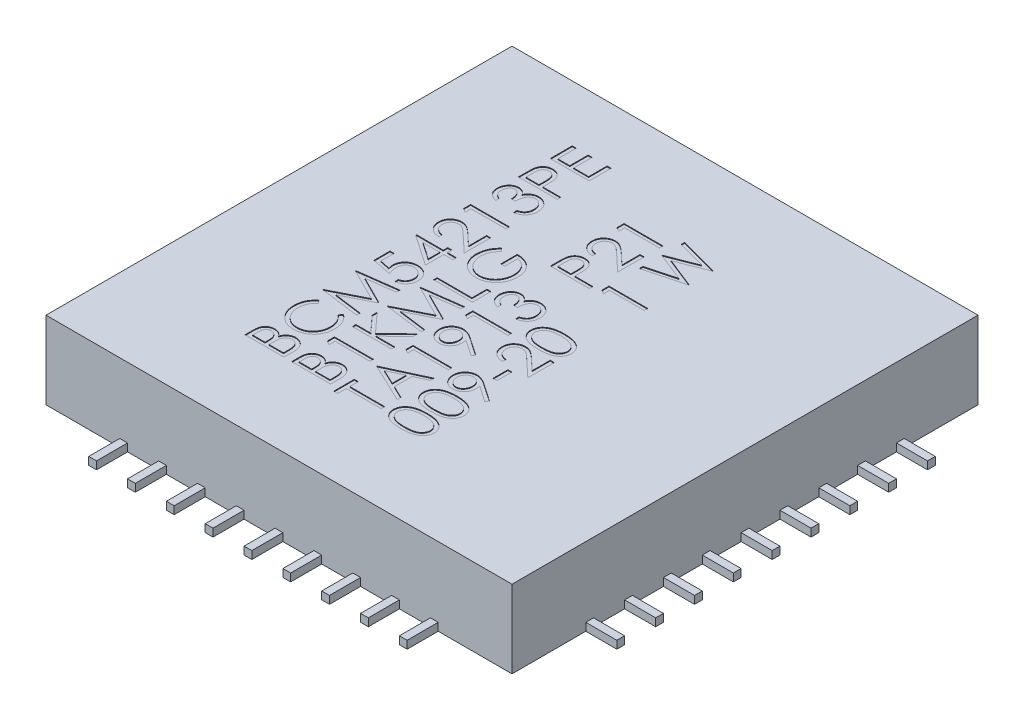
from build123d import *

# Parameters (mm, degrees)
BASES_W                = 6
BASES_H                = 6
BASE_DEPTH             = 1
SOLDERCONNECTIONS_W    = 0.4
SOLDERCONNECTIONS_H    = 0.1
SOLDERCONNECTION_DEPTH = 0.1
SC_LP_COUNT            = 9
SC_LP_PITCH            = 0.5
SC_CP_COUNT            = 4
SC_CP_COPY_1_SKETCH_W  = 0.4
SC_CP_COPY_1_SKETCH_H  = 0.1
SC_CP_COPY_1_DEPTH     = 0.1
SC_CP_COPY_2_SKETCH_W  = 0.4
SC_CP_COPY_2_SKETCH_H  = 0.1
SC_CP_COPY_2_DEPTH     = 0.1
SC_CP_COPY_3_SKETCH_W  = 0.4
SC_CP_COPY_3_SKETCH_H  = 0.1
SC_CP_COPY_3_DEPTH     = 0.1
SC_CP_COPY_4_SKETCH_W  = 0.4
SC_CP_COPY_4_SKETCH_H  = 0.1
SC_CP_COPY_4_DEPTH     = 0.1
SC_CP_COPY_5_SKETCH_W  = 0.4
SC_CP_COPY_5_SKETCH_H  = 0.1
SC_CP_COPY_5_DEPTH     = 0.1
SC_CP_COPY_6_SKETCH_W  = 0.4
SC_CP_COPY_6_SKETCH_H  = 0.1
SC_CP_COPY_6_DEPTH     = 0.1
SC_CP_COPY_7_SKETCH_W  = 0.4
SC_CP_COPY_7_SKETCH_H  = 0.1
SC_CP_COPY_7_DEPTH     = 0.1
SC_CP_COPY_8_SKETCH_W  = 0.4
SC_CP_COPY_8_SKETCH_H  = 0.1
SC_CP_COPY_8_DEPTH     = 0.1
SC_CP_COPY_9_SKETCH_W  = 0.4
SC_CP_COPY_9_SKETCH_H  = 0.1
SC_CP_COPY_9_DEPTH     = 0.1
SC_CP_COPY_10_SKETCH_W = 0.4
SC_CP_COPY_10_SKETCH_H = 0.1
SC_CP_COPY_10_DEPTH    = 0.1
SC_CP_COPY_11_SKETCH_W = 0.4
SC_CP_COPY_11_SKETCH_H = 0.1
SC_CP_COPY_11_DEPTH    = 0.1
SC_CP_COPY_12_SKETCH_W = 0.4
SC_CP_COPY_12_SKETCH_H = 0.1
SC_CP_COPY_12_DEPTH    = 0.1
SC_CP_COPY_13_SKETCH_W = 0.4
SC_CP_COPY_13_SKETCH_H = 0.1
SC_CP_COPY_13_DEPTH    = 0.1
SC_CP_COPY_14_SKETCH_W = 0.4
SC_CP_COPY_14_SKETCH_H = 0.1
SC_CP_COPY_14_DEPTH    = 0.1
SC_CP_COPY_15_SKETCH_W = 0.4
SC_CP_COPY_15_SKETCH_H = 0.1
SC_CP_COPY_15_DEPTH    = 0.1
SC_CP_COPY_16_SKETCH_W = 0.4
SC_CP_COPY_16_SKETCH_H = 0.1
SC_CP_COPY_16_DEPTH    = 0.1
SC_CP_COPY_17_SKETCH_W = 0.4
SC_CP_COPY_17_SKETCH_H = 0.1
SC_CP_COPY_17_DEPTH    = 0.1
SC_CP_COPY_18_SKETCH_W = 0.4
SC_CP_COPY_18_SKETCH_H = 0.1
SC_CP_COPY_18_DEPTH    = 0.1
SC_CP_COPY_19_SKETCH_W = 0.4
SC_CP_COPY_19_SKETCH_H = 0.1
SC_CP_COPY_19_DEPTH    = 0.1
SC_CP_COPY_20_SKETCH_W = 0.4
SC_CP_COPY_20_SKETCH_H = 0.1
SC_CP_COPY_20_DEPTH    = 0.1
SC_CP_COPY_21_SKETCH_W = 0.4
SC_CP_COPY_21_SKETCH_H = 0.1
SC_CP_COPY_21_DEPTH    = 0.1
SC_CP_COPY_22_SKETCH_W = 0.4
SC_CP_COPY_22_SKETCH_H = 0.1
SC_CP_COPY_22_DEPTH    = 0.1
SC_CP_COPY_23_SKETCH_W = 0.4
SC_CP_COPY_23_SKETCH_H = 0.1
SC_CP_COPY_23_DEPTH    = 0.1
SC_CP_COPY_24_SKETCH_W = 0.4
SC_CP_COPY_24_SKETCH_H = 0.1
SC_CP_COPY_24_DEPTH    = 0.1
PARTNO_DEPTH           = 0.01
PARTNOE1_DEPTH         = 0.01
PARTNOE2_DEPTH         = 0.01
PARTNOSE3_W            = 0.051282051
PARTNOSE3_H            = 0.192307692
PARTNOE3_DEPTH         = 0.01


with BuildPart() as part:
    # BaseS → Base (new body)
    with BuildSketch(Plane(origin=(0, 0, 0), x_dir=(1, 0, 0), z_dir=(0, 1, 0))):
        Rectangle(BASES_W, BASES_H)
    extrude(amount=BASE_DEPTH)

    # SolderConnectionS → SolderConnection (add)
    with BuildSketch(Plane(origin=(0, 0, 0), x_dir=(1, 0, 0), z_dir=(0, 1, 0))):
        with Locations((3.2, -2)):
            Rectangle(SOLDERCONNECTIONS_W, SOLDERCONNECTIONS_H)
    solderconnection = extrude(amount=SOLDERCONNECTION_DEPTH)

    # SC LP: SolderConnection ×9
    with Locations(*[(0, 0, -i * SC_LP_PITCH) for i in range(1, SC_LP_COUNT)]):
        add(solderconnection)

    # SC CP: SolderConnection ×4 about axis
    sc_cp_axis = Axis((0, 0, 0), (0, 1, 0))
    for i in range(1, SC_CP_COUNT):
        add(solderconnection.rotate(sc_cp_axis, i * 360 / SC_CP_COUNT))

    # SC CP copy 1 sketch → SC CP copy 1 (add)
    with BuildSketch(Plane(origin=(-0.5, 0, 0), x_dir=(0, 0, -1), z_dir=(0, 1, 0))):
        with Locations((3.2, -2)):
            Rectangle(SC_CP_COPY_1_SKETCH_W, SC_CP_COPY_1_SKETCH_H)
    extrude(amount=SC_CP_COPY_1_DEPTH)

    # SC CP copy 2 sketch → SC CP copy 2 (add)
    with BuildSketch(Plane(origin=(0, 0, 0.5), x_dir=(-1, 0, 0), z_dir=(0, 1, 0))):
        with Locations((3.2, -2)):
            Rectangle(SC_CP_COPY_2_SKETCH_W, SC_CP_COPY_2_SKETCH_H)
    extrude(amount=SC_CP_COPY_2_DEPTH)

    # SC CP copy 3 sketch → SC CP copy 3 (add)
    with BuildSketch(Plane(origin=(0.5, 0, 0), x_dir=(0, 0, 1), z_dir=(0, 1, 0))):
        with Locations((3.2, -2)):
            Rectangle(SC_CP_COPY_3_SKETCH_W, SC_CP_COPY_3_SKETCH_H)
    extrude(amount=SC_CP_COPY_3_DEPTH)

    # SC CP copy 4 sketch → SC CP copy 4 (add)
    with BuildSketch(Plane(origin=(-1, 0, 0), x_dir=(0, 0, -1), z_dir=(0, 1, 0))):
        with Locations((3.2, -2)):
            Rectangle(SC_CP_COPY_4_SKETCH_W, SC_CP_COPY_4_SKETCH_H)
    extrude(amount=SC_CP_COPY_4_DEPTH)

    # SC CP copy 5 sketch → SC CP copy 5 (add)
    with BuildSketch(Plane(origin=(0, 0, 1), x_dir=(-1, 0, 0), z_dir=(0, 1, 0))):
        with Locations((3.2, -2)):
            Rectangle(SC_CP_COPY_5_SKETCH_W, SC_CP_COPY_5_SKETCH_H)
    extrude(amount=SC_CP_COPY_5_DEPTH)

    # SC CP copy 6 sketch → SC CP copy 6 (add)
    with BuildSketch(Plane(origin=(1, 0, 0), x_dir=(0, 0, 1), z_dir=(0, 1, 0))):
        with Locations((3.2, -2)):
            Rectangle(SC_CP_COPY_6_SKETCH_W, SC_CP_COPY_6_SKETCH_H)
    extrude(amount=SC_CP_COPY_6_DEPTH)

    # SC CP copy 7 sketch → SC CP copy 7 (add)
    with BuildSketch(Plane(origin=(-1.5, 0, 0), x_dir=(0, 0, -1), z_dir=(0, 1, 0))):
        with Locations((3.2, -2)):
            Rectangle(SC_CP_COPY_7_SKETCH_W, SC_CP_COPY_7_SKETCH_H)
    extrude(amount=SC_CP_COPY_7_DEPTH)

    # SC CP copy 8 sketch → SC CP copy 8 (add)
    with BuildSketch(Plane(origin=(0, 0, 1.5), x_dir=(-1, 0, 0), z_dir=(0, 1, 0))):
        with Locations((3.2, -2)):
            Rectangle(SC_CP_COPY_8_SKETCH_W, SC_CP_COPY_8_SKETCH_H)
    extrude(amount=SC_CP_COPY_8_DEPTH)

    # SC CP copy 9 sketch → SC CP copy 9 (add)
    with BuildSketch(Plane(origin=(1.5, 0, 0), x_dir=(0, 0, 1), z_dir=(0, 1, 0))):
        with Locations((3.2, -2)):
            Rectangle(SC_CP_COPY_9_SKETCH_W, SC_CP_COPY_9_SKETCH_H)
    extrude(amount=SC_CP_COPY_9_DEPTH)

    # SC CP copy 10 sketch → SC CP copy 10 (add)
    with BuildSketch(Plane(origin=(-2, 0, 0), x_dir=(0, 0, -1), z_dir=(0, 1, 0))):
        with Locations((3.2, -2)):
            Rectangle(SC_CP_COPY_10_SKETCH_W, SC_CP_COPY_10_SKETCH_H)
    extrude(amount=SC_CP_COPY_10_DEPTH)

    # SC CP copy 11 sketch → SC CP copy 11 (add)
    with BuildSketch(Plane(origin=(0, 0, 2), x_dir=(-1, 0, 0), z_dir=(0, 1, 0))):
        with Locations((3.2, -2)):
            Rectangle(SC_CP_COPY_11_SKETCH_W, SC_CP_COPY_11_SKETCH_H)
    extrude(amount=SC_CP_COPY_11_DEPTH)

    # SC CP copy 12 sketch → SC CP copy 12 (add)
    with BuildSketch(Plane(origin=(2, 0, 0), x_dir=(0, 0, 1), z_dir=(0, 1, 0))):
        with Locations((3.2, -2)):
            Rectangle(SC_CP_COPY_12_SKETCH_W, SC_CP_COPY_12_SKETCH_H)
    extrude(amount=SC_CP_COPY_12_DEPTH)

    # SC CP copy 13 sketch → SC CP copy 13 (add)
    with BuildSketch(Plane(origin=(-2.5, 0, 0), x_dir=(0, 0, -1), z_dir=(0, 1, 0))):
        with Locations((3.2, -2)):
            Rectangle(SC_CP_COPY_13_SKETCH_W, SC_CP_COPY_13_SKETCH_H)
    extrude(amount=SC_CP_COPY_13_DEPTH)

    # SC CP copy 14 sketch → SC CP copy 14 (add)
    with BuildSketch(Plane(origin=(0, 0, 2.5), x_dir=(-1, 0, 0), z_dir=(0, 1, 0))):
        with Locations((3.2, -2)):
            Rectangle(SC_CP_COPY_14_SKETCH_W, SC_CP_COPY_14_SKETCH_H)
    extrude(amount=SC_CP_COPY_14_DEPTH)

    # SC CP copy 15 sketch → SC CP copy 15 (add)
    with BuildSketch(Plane(origin=(2.5, 0, 0), x_dir=(0, 0, 1), z_dir=(0, 1, 0))):
        with Locations((3.2, -2)):
            Rectangle(SC_CP_COPY_15_SKETCH_W, SC_CP_COPY_15_SKETCH_H)
    extrude(amount=SC_CP_COPY_15_DEPTH)

    # SC CP copy 16 sketch → SC CP copy 16 (add)
    with BuildSketch(Plane(origin=(-3, 0, 0), x_dir=(0, 0, -1), z_dir=(0, 1, 0))):
        with Locations((3.2, -2)):
            Rectangle(SC_CP_COPY_16_SKETCH_W, SC_CP_COPY_16_SKETCH_H)
    extrude(amount=SC_CP_COPY_16_DEPTH)

    # SC CP copy 17 sketch → SC CP copy 17 (add)
    with BuildSketch(Plane(origin=(0, 0, 3), x_dir=(-1, 0, 0), z_dir=(0, 1, 0))):
        with Locations((3.2, -2)):
            Rectangle(SC_CP_COPY_17_SKETCH_W, SC_CP_COPY_17_SKETCH_H)
    extrude(amount=SC_CP_COPY_17_DEPTH)

    # SC CP copy 18 sketch → SC CP copy 18 (add)
    with BuildSketch(Plane(origin=(3, 0, 0), x_dir=(0, 0, 1), z_dir=(0, 1, 0))):
        with Locations((3.2, -2)):
            Rectangle(SC_CP_COPY_18_SKETCH_W, SC_CP_COPY_18_SKETCH_H)
    extrude(amount=SC_CP_COPY_18_DEPTH)

    # SC CP copy 19 sketch → SC CP copy 19 (add)
    with BuildSketch(Plane(origin=(-3.5, 0, 0), x_dir=(0, 0, -1), z_dir=(0, 1, 0))):
        with Locations((3.2, -2)):
            Rectangle(SC_CP_COPY_19_SKETCH_W, SC_CP_COPY_19_SKETCH_H)
    extrude(amount=SC_CP_COPY_19_DEPTH)

    # SC CP copy 20 sketch → SC CP copy 20 (add)
    with BuildSketch(Plane(origin=(0, 0, 3.5), x_dir=(-1, 0, 0), z_dir=(0, 1, 0))):
        with Locations((3.2, -2)):
            Rectangle(SC_CP_COPY_20_SKETCH_W, SC_CP_COPY_20_SKETCH_H)
    extrude(amount=SC_CP_COPY_20_DEPTH)

    # SC CP copy 21 sketch → SC CP copy 21 (add)
    with BuildSketch(Plane(origin=(3.5, 0, 0), x_dir=(0, 0, 1), z_dir=(0, 1, 0))):
        with Locations((3.2, -2)):
            Rectangle(SC_CP_COPY_21_SKETCH_W, SC_CP_COPY_21_SKETCH_H)
    extrude(amount=SC_CP_COPY_21_DEPTH)

    # SC CP copy 22 sketch → SC CP copy 22 (add)
    with BuildSketch(Plane(origin=(-4, 0, 0), x_dir=(0, 0, -1), z_dir=(0, 1, 0))):
        with Locations((3.2, -2)):
            Rectangle(SC_CP_COPY_22_SKETCH_W, SC_CP_COPY_22_SKETCH_H)
    extrude(amount=SC_CP_COPY_22_DEPTH)

    # SC CP copy 23 sketch → SC CP copy 23 (add)
    with BuildSketch(Plane(origin=(0, 0, 4), x_dir=(-1, 0, 0), z_dir=(0, 1, 0))):
        with Locations((3.2, -2)):
            Rectangle(SC_CP_COPY_23_SKETCH_W, SC_CP_COPY_23_SKETCH_H)
    extrude(amount=SC_CP_COPY_23_DEPTH)

    # SC CP copy 24 sketch → SC CP copy 24 (add)
    with BuildSketch(Plane(origin=(4, 0, 0), x_dir=(0, 0, 1), z_dir=(0, 1, 0))):
        with Locations((3.2, -2)):
            Rectangle(SC_CP_COPY_24_SKETCH_W, SC_CP_COPY_24_SKETCH_H)
    extrude(amount=SC_CP_COPY_24_DEPTH)

    # PartNoS → PartNo (cut)
    # profile 1 of 10: a face of its own
    with BuildSketch(Plane(origin=(0, 1, 0), x_dir=(1, 0, 0), z_dir=(0, 1, 0))):
        with BuildLine():
            Line((-1.5, -1.935897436), (-1.5, -1.838341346))
            add(Edge.make_bspline(
                [(-1.5, -1.838341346), (-1.499975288, -1.833565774), (-1.49992739, -1.824309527), (-1.499167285, -1.81085063), (-1.498156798, -1.798240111), (-1.49646176, -1.786500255), (-1.494704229, -1.775554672), (-1.492124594, -1.765514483), (-1.489275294, -1.756295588), (-1.484891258, -1.745225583), (-1.478082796, -1.732665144), (-1.467985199, -1.719165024), (-1.455878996, -1.707429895), (-1.442083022, -1.697451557), (-1.426905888, -1.689443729), (-1.410674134, -1.683723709), (-1.393660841, -1.680048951), (-1.381996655, -1.679675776), (-1.376101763, -1.679487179)],
                knots=[0, 0, 0, 0, 1.00128172, 1.940733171, 2.826250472, 3.653024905, 4.427672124, 5.149348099, 5.824709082, 6.450061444, 7.643590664, 8.808605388, 9.972104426, 11.165284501, 12.367876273, 13.557044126, 14.765369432, 16, 16, 16, 16], degree=3))
            add(Edge.make_bspline(
                [(-1.376101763, -1.679487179), (-1.370580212, -1.679644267), (-1.359729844, -1.679952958), (-1.343887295, -1.682868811), (-1.328821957, -1.687496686), (-1.314546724, -1.693892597), (-1.301327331, -1.702133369), (-1.289204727, -1.712006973), (-1.27863708, -1.723870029), (-1.272731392, -1.732762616), (-1.269731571, -1.737279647)],
                knots=[0, 0, 0, 0, 1.044641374, 2.052818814, 3.038628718, 4.023282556, 5.005660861, 5.98021751, 6.974042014, 8, 8, 8, 8], degree=3))
            add(Edge.make_bspline(
                [(-1.269731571, -1.737279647), (-1.26755015, -1.731600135), (-1.263376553, -1.72073382), (-1.256009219, -1.70577156), (-1.24796707, -1.692927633), (-1.239320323, -1.681951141), (-1.229862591, -1.672612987), (-1.219517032, -1.664525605), (-1.208292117, -1.657533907), (-1.196229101, -1.651584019), (-1.183430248, -1.646910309), (-1.170051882, -1.643475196), (-1.15614529, -1.641443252), (-1.146707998, -1.641166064), (-1.141927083, -1.641025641)],
                knots=[0, 0, 0, 0, 1.272586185, 2.434772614, 3.483318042, 4.437947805, 5.351807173, 6.25737843, 7.180033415, 8.1141739, 9.066731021, 10.025721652, 10.999834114, 12, 12, 12, 12], degree=3))
            add(Edge.make_bspline(
                [(-1.141927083, -1.641025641), (-1.137046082, -1.64116516), (-1.127442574, -1.641439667), (-1.113334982, -1.643465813), (-1.099851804, -1.646894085), (-1.086912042, -1.651624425), (-1.074542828, -1.657755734), (-1.062788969, -1.665325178), (-1.051626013, -1.674226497), (-1.041034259, -1.684286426), (-1.03134247, -1.695497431), (-1.0230108, -1.707852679), (-1.015846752, -1.721013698), (-1.010014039, -1.735148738), (-1.005514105, -1.750221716), (-1.002378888, -1.766224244), (-1.00026284, -1.783129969), (-1.0000891, -1.794731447), (-1, -1.80068109)],
                knots=[0, 0, 0, 0, 0.978680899, 1.925582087, 2.851223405, 3.764209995, 4.683484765, 5.614004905, 6.562443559, 7.542772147, 8.539900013, 9.527881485, 10.525548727, 11.540192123, 12.58875426, 13.674701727, 14.807505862, 16, 16, 16, 16], degree=3))
            Line((-1, -1.80068109), (-1, -1.935897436))
            Line((-1, -1.935897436), (-1.5, -1.935897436))
        make_face()
        with BuildLine():
            Line((-1.448717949, -1.891025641), (-1.288461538, -1.891025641))
            Line((-1.288461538, -1.891025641), (-1.288461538, -1.860877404))
            add(Edge.make_bspline(
                [(-1.288461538, -1.860877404), (-1.28851867, -1.856470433), (-1.288629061, -1.847955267), (-1.288945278, -1.835623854), (-1.289830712, -1.824177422), (-1.290715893, -1.813635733), (-1.292155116, -1.804015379), (-1.29386829, -1.7953377), (-1.29568009, -1.787466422), (-1.298761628, -1.778389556), (-1.303314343, -1.768091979), (-1.310386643, -1.757121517), (-1.318803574, -1.747405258), (-1.328606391, -1.739298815), (-1.339283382, -1.732605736), (-1.350740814, -1.727917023), (-1.36274812, -1.724791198), (-1.371007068, -1.724504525), (-1.375200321, -1.724358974)],
                knots=[0, 0, 0, 0, 1.156917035, 2.235399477, 3.236897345, 4.169954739, 5.01148057, 5.788325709, 6.491867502, 7.129259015, 8.302032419, 9.437271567, 10.542795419, 11.662606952, 12.764338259, 13.836858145, 14.901724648, 16, 16, 16, 16], degree=3))
            add(Edge.make_bspline(
                [(-1.375200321, -1.724358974), (-1.377975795, -1.724432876), (-1.38342019, -1.724577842), (-1.391382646, -1.725808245), (-1.398864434, -1.727801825), (-1.405937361, -1.73050167), (-1.412425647, -1.734190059), (-1.418639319, -1.738465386), (-1.424206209, -1.743743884), (-1.429394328, -1.749709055), (-1.434037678, -1.756534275), (-1.437883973, -1.764366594), (-1.441369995, -1.773003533), (-1.443950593, -1.782679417), (-1.446219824, -1.79319376), (-1.447645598, -1.804688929), (-1.448563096, -1.817092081), (-1.44866518, -1.825685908), (-1.448717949, -1.830128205)],
                knots=[0, 0, 0, 0, 0.911708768, 1.788416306, 2.640049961, 3.452993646, 4.268229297, 5.087074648, 5.92553149, 6.781184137, 7.681934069, 8.628939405, 9.643570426, 10.73771997, 11.914765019, 13.176320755, 14.540391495, 16, 16, 16, 16], degree=3))
            Line((-1.448717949, -1.830128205), (-1.448717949, -1.891025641))
        make_face(mode=Mode.SUBTRACT)
        with BuildLine():
            Line((-1.237179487, -1.891025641), (-1.051282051, -1.891025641))
            Line((-1.051282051, -1.891025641), (-1.051282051, -1.827123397))
            add(Edge.make_bspline(
                [(-1.051282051, -1.827123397), (-1.051342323, -1.822549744), (-1.05145849, -1.813734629), (-1.051730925, -1.800997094), (-1.052761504, -1.789222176), (-1.053712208, -1.778372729), (-1.055337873, -1.768477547), (-1.056872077, -1.759460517), (-1.059149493, -1.751469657), (-1.062279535, -1.742118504), (-1.067290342, -1.731666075), (-1.074611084, -1.720243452), (-1.08364601, -1.710283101), (-1.093921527, -1.701733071), (-1.105063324, -1.694677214), (-1.116925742, -1.689613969), (-1.12927808, -1.686467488), (-1.137702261, -1.686087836), (-1.141927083, -1.685897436)],
                knots=[0, 0, 0, 0, 1.160376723, 2.23647316, 3.230273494, 4.158083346, 4.997711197, 5.773399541, 6.476071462, 7.102777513, 8.27340052, 9.405620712, 10.53304798, 11.669441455, 12.787990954, 13.865552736, 14.929550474, 16, 16, 16, 16], degree=3))
            add(Edge.make_bspline(
                [(-1.141927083, -1.685897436), (-1.144569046, -1.685936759), (-1.149810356, -1.68601477), (-1.157511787, -1.687196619), (-1.164975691, -1.688906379), (-1.172233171, -1.691158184), (-1.179162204, -1.694306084), (-1.185789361, -1.698165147), (-1.192248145, -1.70258253), (-1.200519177, -1.709397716), (-1.209930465, -1.719455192), (-1.21903088, -1.733747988), (-1.226488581, -1.749909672), (-1.229641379, -1.761658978), (-1.231270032, -1.767728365)],
                knots=[0, 0, 0, 0, 0.723302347, 1.434937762, 2.129609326, 2.821140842, 3.513216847, 4.209993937, 4.920569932, 5.655069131, 7.14393391, 8.6716197, 10.280644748, 12, 12, 12, 12], degree=3))
            add(Edge.make_bspline(
                [(-1.231270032, -1.767728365), (-1.231763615, -1.770161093), (-1.232833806, -1.775435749), (-1.233963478, -1.784036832), (-1.234969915, -1.793856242), (-1.235714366, -1.804916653), (-1.236483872, -1.817232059), (-1.236783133, -1.830828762), (-1.23714017, -1.845651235), (-1.237166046, -1.85593586), (-1.237179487, -1.861278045)],
                knots=[0, 0, 0, 0, 0.634451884, 1.375622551, 2.216452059, 3.157844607, 4.20941857, 5.370758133, 6.634282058, 8, 8, 8, 8], degree=3))
            Line((-1.237179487, -1.861278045), (-1.237179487, -1.891025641))
        make_face(mode=Mode.SUBTRACT)
    # profile 2 of 10: a face of its own
    with BuildSketch(Plane(origin=(0, 1, 0), x_dir=(1, 0, 0), z_dir=(0, 1, 0))):
        with BuildLine():
            Line((-1.408253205, -1.076923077), (-1.378205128, -1.116185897))
            add(Edge.make_bspline(
                [(-1.378205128, -1.116185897), (-1.38154308, -1.118986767), (-1.38817398, -1.124550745), (-1.397485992, -1.133501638), (-1.406207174, -1.142832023), (-1.41439356, -1.152528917), (-1.421716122, -1.16281673), (-1.428745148, -1.173303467), (-1.434899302, -1.184370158), (-1.442417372, -1.199595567), (-1.45009142, -1.219590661), (-1.456691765, -1.24467421), (-1.46085379, -1.270895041), (-1.461307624, -1.288779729), (-1.461538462, -1.297876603)],
                knots=[0, 0, 0, 0, 0.75789156, 1.505565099, 2.245254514, 2.979266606, 3.711207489, 4.440978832, 5.174393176, 5.91211879, 7.394186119, 8.890401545, 10.418332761, 12, 12, 12, 12], degree=3))
            add(Edge.make_bspline(
                [(-1.461538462, -1.297876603), (-1.461480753, -1.302888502), (-1.46136587, -1.312865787), (-1.459850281, -1.327672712), (-1.457720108, -1.342203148), (-1.454559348, -1.356447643), (-1.450563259, -1.370388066), (-1.4457882, -1.384115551), (-1.439880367, -1.397431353), (-1.433350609, -1.410519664), (-1.425975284, -1.423059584), (-1.417930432, -1.434924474), (-1.409306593, -1.446071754), (-1.400069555, -1.4565077), (-1.390267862, -1.466252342), (-1.379791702, -1.475183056), (-1.368753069, -1.483419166), (-1.357142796, -1.49091373), (-1.345069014, -1.497660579), (-1.332462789, -1.503333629), (-1.319539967, -1.508288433), (-1.306208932, -1.51227081), (-1.29255829, -1.515398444), (-1.27853149, -1.517560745), (-1.264155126, -1.51905877), (-1.254410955, -1.519173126), (-1.249499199, -1.519230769)],
                knots=[0, 0, 0, 0, 1.054877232, 2.099964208, 3.13098259, 4.145888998, 5.169474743, 6.183358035, 7.203388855, 8.234598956, 9.261847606, 10.264062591, 11.251197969, 12.227332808, 13.196685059, 14.158975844, 15.123498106, 16.094582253, 17.066912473, 18.032714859, 19.002806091, 19.979168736, 20.95977404, 21.949109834, 22.966205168, 24, 24, 24, 24], degree=3))
            add(Edge.make_bspline(
                [(-1.249499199, -1.519230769), (-1.242109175, -1.519050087), (-1.227599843, -1.518695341), (-1.20634456, -1.515551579), (-1.185962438, -1.510735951), (-1.166591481, -1.503636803), (-1.14807021, -1.494708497), (-1.130623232, -1.483568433), (-1.113994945, -1.470617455), (-1.098588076, -1.455722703), (-1.084514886, -1.439378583), (-1.072121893, -1.421843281), (-1.06179121, -1.403159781), (-1.053194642, -1.383534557), (-1.046586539, -1.362816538), (-1.041934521, -1.341042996), (-1.038899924, -1.318261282), (-1.038609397, -1.302694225), (-1.038461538, -1.294771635)],
                knots=[0, 0, 0, 0, 1.029159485, 2.020618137, 2.987588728, 3.942669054, 4.889339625, 5.846988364, 6.821327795, 7.821533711, 8.827683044, 9.822769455, 10.807800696, 11.797391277, 12.803701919, 13.832062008, 14.896664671, 16, 16, 16, 16], degree=3))
            add(Edge.make_bspline(
                [(-1.038461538, -1.294771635), (-1.038702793, -1.286042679), (-1.039177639, -1.268862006), (-1.043200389, -1.243666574), (-1.049722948, -1.219547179), (-1.058851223, -1.196502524), (-1.070717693, -1.174597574), (-1.085103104, -1.153798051), (-1.102144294, -1.134086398), (-1.11515617, -1.122233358), (-1.121794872, -1.116185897)],
                knots=[0, 0, 0, 0, 1.028121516, 2.023589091, 2.998037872, 3.967518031, 4.937445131, 5.927275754, 6.942489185, 8, 8, 8, 8], degree=3))
            Line((-1.121794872, -1.116185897), (-1.092047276, -1.076923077))
            add(Edge.make_bspline(
                [(-1.092047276, -1.076923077), (-1.087970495, -1.080082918), (-1.079836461, -1.086387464), (-1.068366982, -1.096594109), (-1.057588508, -1.107354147), (-1.047554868, -1.118695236), (-1.038224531, -1.130637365), (-1.029592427, -1.143179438), (-1.021704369, -1.15631075), (-1.0144588, -1.169927), (-1.008079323, -1.184059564), (-1.002426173, -1.198584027), (-0.99774599, -1.213589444), (-0.993787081, -1.228949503), (-0.9909642, -1.244802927), (-0.988716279, -1.260965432), (-0.987382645, -1.277588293), (-0.987247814, -1.288793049), (-0.987179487, -1.294471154)],
                knots=[0, 0, 0, 0, 0.986911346, 1.969095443, 2.935967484, 3.900112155, 4.865124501, 5.834589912, 6.812044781, 7.795288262, 8.784678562, 9.777857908, 10.776141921, 11.791195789, 12.811324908, 13.855933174, 14.913475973, 16, 16, 16, 16], degree=3))
            add(Edge.make_bspline(
                [(-0.987179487, -1.294471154), (-0.987216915, -1.299848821), (-0.987290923, -1.310482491), (-0.988489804, -1.326182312), (-0.990125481, -1.341466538), (-0.992588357, -1.356291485), (-0.995494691, -1.370738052), (-0.999390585, -1.384675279), (-1.003754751, -1.398240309), (-1.008884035, -1.411378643), (-1.014672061, -1.424101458), (-1.021213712, -1.436367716), (-1.028453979, -1.448171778), (-1.036233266, -1.459629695), (-1.044801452, -1.470572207), (-1.054039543, -1.481094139), (-1.063916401, -1.491254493), (-1.071038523, -1.497540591), (-1.074619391, -1.500701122)],
                knots=[0, 0, 0, 0, 1.114604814, 2.203992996, 3.262667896, 4.300477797, 5.318619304, 6.316056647, 7.298880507, 8.271930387, 9.238335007, 10.195173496, 11.151986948, 12.108099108, 13.064862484, 14.031167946, 15.010108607, 16, 16, 16, 16], degree=3))
            add(Edge.make_bspline(
                [(-1.074619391, -1.500701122), (-1.080839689, -1.505763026), (-1.093205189, -1.515825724), (-1.113244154, -1.528705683), (-1.134147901, -1.539694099), (-1.156037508, -1.548677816), (-1.178921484, -1.555578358), (-1.202763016, -1.560429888), (-1.227514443, -1.563560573), (-1.244348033, -1.563919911), (-1.252904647, -1.564102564)],
                knots=[0, 0, 0, 0, 0.994611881, 1.977215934, 2.950189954, 3.921972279, 4.908960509, 5.911694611, 6.938501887, 8, 8, 8, 8], degree=3))
            add(Edge.make_bspline(
                [(-1.252904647, -1.564102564), (-1.261898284, -1.563880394), (-1.279592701, -1.563443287), (-1.305560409, -1.559729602), (-1.33043918, -1.553755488), (-1.354182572, -1.545270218), (-1.37691547, -1.534512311), (-1.398464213, -1.521222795), (-1.418966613, -1.50555606), (-1.438111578, -1.487634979), (-1.455617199, -1.467982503), (-1.471018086, -1.446936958), (-1.483834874, -1.424539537), (-1.494548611, -1.401036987), (-1.502783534, -1.376253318), (-1.508548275, -1.350241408), (-1.512136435, -1.323050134), (-1.512590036, -1.304498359), (-1.512820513, -1.295072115)],
                knots=[0, 0, 0, 0, 1.032925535, 2.032216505, 3.007276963, 3.968222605, 4.92396291, 5.891752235, 6.871517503, 7.883894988, 8.900124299, 9.891468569, 10.874487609, 11.85992873, 12.854644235, 13.869047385, 14.917252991, 16, 16, 16, 16], degree=3))
            add(Edge.make_bspline(
                [(-1.512820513, -1.295072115), (-1.512751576, -1.28932721), (-1.512615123, -1.277955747), (-1.511286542, -1.261133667), (-1.50906712, -1.244757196), (-1.506062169, -1.228809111), (-1.50227804, -1.213243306), (-1.497561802, -1.198088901), (-1.49194679, -1.183383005), (-1.485534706, -1.169130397), (-1.478324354, -1.15542729), (-1.470400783, -1.142282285), (-1.461804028, -1.129747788), (-1.452446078, -1.117888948), (-1.442404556, -1.106691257), (-1.431797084, -1.095988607), (-1.420351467, -1.086092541), (-1.412293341, -1.07998516), (-1.408253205, -1.076923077)],
                knots=[0, 0, 0, 0, 1.096622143, 2.170653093, 3.219033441, 4.250379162, 5.267604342, 6.275621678, 7.278284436, 8.271072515, 9.257558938, 10.232633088, 11.19973724, 12.157384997, 13.114417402, 14.069920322, 15.032307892, 16, 16, 16, 16], degree=3))
        make_face()
    # profile 3 of 10: a face of its own
    with BuildSketch(Plane(origin=(0, 1, 0), x_dir=(1, 0, 0), z_dir=(0, 1, 0))):
        Polygon((-1, -1), (-1.5, -0.933994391), (-1.5, -0.927584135), (-1.08974359, -0.721153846), (-1.5, -0.515224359), (-1.5, -0.508713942), (-1, -0.442307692), (-1, -0.487379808), (-1.359775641, -0.53525641), (-1, -0.715745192), (-1, -0.725861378), (-1.360576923, -0.907051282), (-1, -0.954827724), align=None)
    # profile 4 of 10: a face of its own
    with BuildSketch(Plane(origin=(0, 1, 0), x_dir=(1, 0, 0), z_dir=(0, 1, 0))):
        with BuildLine():
            Line((-1.5, -0.070512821), (-1.448717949, -0.070512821))
            Line((-1.448717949, -0.070512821), (-1.448717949, -0.240584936))
            Line((-1.448717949, -0.240584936), (-1.317207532, -0.267528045))
            add(Edge.make_bspline(
                [(-1.317207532, -0.267528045), (-1.318668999, -0.262234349), (-1.321500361, -0.251978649), (-1.324644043, -0.236841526), (-1.326539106, -0.222471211), (-1.326797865, -0.213146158), (-1.326923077, -0.208633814)],
                knots=[0, 0, 0, 0, 1.100273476, 2.13160584, 3.095893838, 4, 4, 4, 4], degree=3))
            add(Edge.make_bspline(
                [(-1.326923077, -0.208633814), (-1.32680622, -0.203049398), (-1.32657645, -0.19206904), (-1.324239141, -0.176028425), (-1.320853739, -0.160638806), (-1.315637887, -0.146127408), (-1.309268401, -0.132264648), (-1.301245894, -0.119288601), (-1.291879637, -0.107017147), (-1.281217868, -0.095535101), (-1.269362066, -0.08516753), (-1.256561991, -0.076158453), (-1.243096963, -0.068295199), (-1.228651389, -0.062162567), (-1.213497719, -0.057157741), (-1.197461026, -0.053857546), (-1.180683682, -0.051653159), (-1.169211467, -0.051407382), (-1.163361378, -0.051282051)],
                knots=[0, 0, 0, 0, 1.052805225, 2.070078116, 3.052532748, 4.020689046, 4.973125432, 5.925915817, 6.89216474, 7.881560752, 8.877013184, 9.857446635, 10.830895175, 11.812622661, 12.812548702, 13.836681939, 14.896847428, 16, 16, 16, 16], degree=3))
            add(Edge.make_bspline(
                [(-1.163361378, -0.051282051), (-1.159286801, -0.051377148), (-1.15119271, -0.051566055), (-1.139171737, -0.052524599), (-1.127407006, -0.054377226), (-1.115920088, -0.056834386), (-1.104700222, -0.060114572), (-1.09368459, -0.063951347), (-1.082993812, -0.068720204), (-1.072580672, -0.074007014), (-1.062564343, -0.079861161), (-1.053184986, -0.086444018), (-1.044228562, -0.093283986), (-1.035961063, -0.100757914), (-1.028350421, -0.108780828), (-1.02135901, -0.117308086), (-1.014861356, -0.126262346), (-1.00912313, -0.135784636), (-1.003842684, -0.145662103), (-0.999510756, -0.156037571), (-0.995637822, -0.166674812), (-0.992550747, -0.177726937), (-0.990131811, -0.18916891), (-0.988488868, -0.201019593), (-0.987292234, -0.213216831), (-0.987217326, -0.22148469), (-0.987179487, -0.225661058)],
                knots=[0, 0, 0, 0, 1.056393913, 2.098511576, 3.122979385, 4.141471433, 5.141222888, 6.151259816, 7.162667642, 8.172852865, 9.177685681, 10.166741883, 11.141342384, 12.097242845, 13.052202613, 14.005160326, 14.953864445, 15.917140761, 16.884916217, 17.854238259, 18.828761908, 19.81781811, 20.826036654, 21.857789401, 22.917898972, 24, 24, 24, 24], degree=3))
            add(Edge.make_bspline(
                [(-0.987179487, -0.225661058), (-0.987278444, -0.230642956), (-0.987473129, -0.240444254), (-0.989500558, -0.254806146), (-0.992423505, -0.268615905), (-0.99675401, -0.281814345), (-1.002424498, -0.29434642), (-1.009161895, -0.306391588), (-1.017182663, -0.317800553), (-1.026413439, -0.328495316), (-1.036556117, -0.338326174), (-1.047457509, -0.347240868), (-1.059131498, -0.355078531), (-1.071540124, -0.361867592), (-1.084661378, -0.367651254), (-1.098535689, -0.37219674), (-1.113092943, -0.375864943), (-1.123114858, -0.377416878), (-1.128205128, -0.378205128)],
                knots=[0, 0, 0, 0, 1.046872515, 2.059598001, 3.044168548, 4.012104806, 4.973680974, 5.932408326, 6.910122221, 7.900780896, 8.89867654, 9.876692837, 10.858029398, 11.85084981, 12.847361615, 13.868568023, 14.917415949, 16, 16, 16, 16], degree=3))
            Line((-1.128205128, -0.378205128), (-1.128205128, -0.333333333))
            add(Edge.make_bspline(
                [(-1.128205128, -0.333333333), (-1.123436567, -0.332229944), (-1.114271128, -0.33010917), (-1.101401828, -0.325442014), (-1.08992966, -0.319791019), (-1.07978448, -0.312914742), (-1.070780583, -0.304944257), (-1.062841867, -0.29567898), (-1.055671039, -0.28535054), (-1.049683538, -0.273867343), (-1.044639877, -0.261729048), (-1.041040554, -0.249097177), (-1.038861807, -0.236153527), (-1.038595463, -0.227438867), (-1.038461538, -0.223056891)],
                knots=[0, 0, 0, 0, 1.13623081, 2.183898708, 3.172478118, 4.09966615, 5.022692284, 5.957376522, 6.927682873, 7.937366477, 8.960015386, 9.976409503, 10.982481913, 12, 12, 12, 12], degree=3))
            add(Edge.make_bspline(
                [(-1.038461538, -0.223056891), (-1.038579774, -0.218777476), (-1.038812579, -0.210351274), (-1.040575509, -0.19794444), (-1.043361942, -0.186001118), (-1.047265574, -0.174500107), (-1.052429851, -0.163497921), (-1.058773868, -0.153010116), (-1.066139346, -0.142887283), (-1.07455782, -0.133395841), (-1.083840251, -0.12470495), (-1.09376532, -0.117025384), (-1.104353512, -0.110628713), (-1.115421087, -0.105238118), (-1.127089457, -0.101144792), (-1.139303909, -0.098224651), (-1.152094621, -0.096509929), (-1.160818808, -0.096274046), (-1.165264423, -0.096153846)],
                knots=[0, 0, 0, 0, 1.027268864, 2.022700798, 3.002744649, 3.968653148, 4.933396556, 5.915045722, 6.907600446, 7.935526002, 8.956456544, 9.95700807, 10.942805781, 11.92166854, 12.907987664, 13.905483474, 14.932689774, 16, 16, 16, 16], degree=3))
            add(Edge.make_bspline(
                [(-1.165264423, -0.096153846), (-1.169275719, -0.096245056), (-1.177094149, -0.096422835), (-1.188572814, -0.09796185), (-1.199451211, -0.10053275), (-1.209776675, -0.104193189), (-1.219516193, -0.108761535), (-1.228648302, -0.114497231), (-1.237258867, -0.121156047), (-1.245126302, -0.128930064), (-1.252399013, -0.137386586), (-1.258576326, -0.146742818), (-1.263829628, -0.156748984), (-1.268133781, -0.167423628), (-1.271562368, -0.178779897), (-1.273931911, -0.190823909), (-1.27534981, -0.203558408), (-1.275542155, -0.212269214), (-1.275641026, -0.216746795)],
                knots=[0, 0, 0, 0, 1.045723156, 2.038222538, 3.013889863, 3.95567481, 4.890389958, 5.81331128, 6.76251276, 7.723027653, 8.692928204, 9.666105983, 10.639751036, 11.635719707, 12.66315958, 13.728667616, 14.832476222, 16, 16, 16, 16], degree=3))
            add(Edge.make_bspline(
                [(-1.275641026, -0.216746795), (-1.275558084, -0.220622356), (-1.275386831, -0.228624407), (-1.274125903, -0.240899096), (-1.272091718, -0.253797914), (-1.269293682, -0.267271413), (-1.2656321, -0.281360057), (-1.261244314, -0.296034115), (-1.255998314, -0.311324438), (-1.252036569, -0.32162697), (-1.25, -0.326923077)],
                knots=[0, 0, 0, 0, 0.817624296, 1.688186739, 2.600797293, 3.572016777, 4.590301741, 5.671205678, 6.80286297, 8, 8, 8, 8], degree=3))
            Line((-1.25, -0.326923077), (-1.5, -0.275641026))
            Line((-1.5, -0.275641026), (-1.5, -0.070512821))
        make_face()
    # profile 5 of 10: a face of its own
    with BuildSketch(Plane(origin=(0, 1, 0), x_dir=(1, 0, 0), z_dir=(0, 1, 0))):
        Polygon((-1.512820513, 0.272936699), (-1.512820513, 0.282051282), (-1.166666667, 0.282051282), (-1.166666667, 0.33974359), (-1.115384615, 0.33974359), (-1.115384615, 0.282051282), (-1, 0.282051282), (-1, 0.237179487), (-1.115384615, 0.237179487), (-1.115384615, 0), align=None)
        Polygon((-1.166666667, 0.237179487), (-1.383814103, 0.237179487), (-1.166666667, 0.088141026), align=None, mode=Mode.SUBTRACT)
    # profile 6 of 10: a face of its own
    with BuildSketch(Plane(origin=(0, 1, 0), x_dir=(1, 0, 0), z_dir=(0, 1, 0))):
        with BuildLine():
            Line((-1.346153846, 0.448717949), (-1.346153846, 0.403846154))
            add(Edge.make_bspline(
                [(-1.346153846, 0.403846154), (-1.35210683, 0.404138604), (-1.363798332, 0.404712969), (-1.380844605, 0.407402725), (-1.397138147, 0.411251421), (-1.412548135, 0.416693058), (-1.427210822, 0.423451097), (-1.441067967, 0.431555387), (-1.454066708, 0.441154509), (-1.466086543, 0.452041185), (-1.477113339, 0.463865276), (-1.486635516, 0.476623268), (-1.494680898, 0.4900297), (-1.501406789, 0.5040439), (-1.506455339, 0.51882398), (-1.510201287, 0.534235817), (-1.512455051, 0.550347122), (-1.512697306, 0.561324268), (-1.512820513, 0.566907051)],
                knots=[0, 0, 0, 0, 1.10065271, 2.161652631, 3.183658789, 4.190468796, 5.17591951, 6.163126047, 7.15150782, 8.156236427, 9.156009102, 10.134482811, 11.092018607, 12.041330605, 13.001268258, 13.972401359, 14.968799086, 16, 16, 16, 16], degree=3))
            add(Edge.make_bspline(
                [(-1.512820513, 0.566907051), (-1.512693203, 0.572390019), (-1.512443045, 0.583163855), (-1.510262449, 0.598881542), (-1.50692088, 0.613879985), (-1.501969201, 0.627989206), (-1.495755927, 0.641354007), (-1.488028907, 0.653808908), (-1.479153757, 0.665655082), (-1.468685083, 0.67631114), (-1.45751498, 0.686100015), (-1.445585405, 0.694537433), (-1.433249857, 0.701803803), (-1.420411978, 0.707751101), (-1.40702996, 0.712259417), (-1.393232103, 0.715599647), (-1.37885917, 0.717509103), (-1.369129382, 0.717800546), (-1.364182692, 0.717948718)],
                knots=[0, 0, 0, 0, 1.111674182, 2.184400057, 3.212814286, 4.223731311, 5.211378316, 6.196328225, 7.191884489, 8.207283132, 9.220262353, 10.201199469, 11.166417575, 12.120932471, 13.06540007, 14.026332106, 14.996573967, 16, 16, 16, 16], degree=3))
            add(Edge.make_bspline(
                [(-1.364182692, 0.717948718), (-1.357218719, 0.717706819), (-1.34341298, 0.717227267), (-1.323125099, 0.713125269), (-1.303469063, 0.706718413), (-1.287648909, 0.699005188), (-1.274902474, 0.691221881), (-1.264402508, 0.684215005), (-1.253099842, 0.675965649), (-1.240948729, 0.666544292), (-1.228108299, 0.655788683), (-1.214316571, 0.643978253), (-1.199828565, 0.630807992), (-1.189926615, 0.621572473), (-1.184795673, 0.616786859)],
                knots=[0, 0, 0, 0, 1.184416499, 2.348048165, 3.509039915, 4.696071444, 5.333504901, 6.05069495, 6.844171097, 7.714965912, 8.667477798, 9.695072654, 10.805644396, 12, 12, 12, 12], degree=3))
            Line((-1.184795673, 0.616786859), (-1.051282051, 0.491686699))
            Line((-1.051282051, 0.491686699), (-1.051282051, 0.724358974))
            Line((-1.051282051, 0.724358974), (-1, 0.724358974))
            Line((-1, 0.724358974), (-1, 0.384615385))
            Line((-1, 0.384615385), (-1.20693109, 0.578525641))
            add(Edge.make_bspline(
                [(-1.20693109, 0.578525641), (-1.211859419, 0.583246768), (-1.221325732, 0.592315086), (-1.235146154, 0.605141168), (-1.247967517, 0.616661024), (-1.259765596, 0.626949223), (-1.270712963, 0.635782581), (-1.280455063, 0.643621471), (-1.289419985, 0.64990227), (-1.299811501, 0.656718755), (-1.312498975, 0.663320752), (-1.328003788, 0.668993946), (-1.343964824, 0.67245321), (-1.354750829, 0.672868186), (-1.360176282, 0.673076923)],
                knots=[0, 0, 0, 0, 1.329631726, 2.553950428, 3.673215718, 4.687767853, 5.603093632, 6.413772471, 7.123043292, 7.734684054, 8.834405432, 9.900288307, 10.943827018, 12, 12, 12, 12], degree=3))
            add(Edge.make_bspline(
                [(-1.360176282, 0.673076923), (-1.36358791, 0.672986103), (-1.370311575, 0.672807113), (-1.38016954, 0.671227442), (-1.389678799, 0.668840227), (-1.398868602, 0.665419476), (-1.407646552, 0.660904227), (-1.416023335, 0.65540803), (-1.424121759, 0.649066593), (-1.431715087, 0.641730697), (-1.438669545, 0.633671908), (-1.444830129, 0.625158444), (-1.449978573, 0.616151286), (-1.454199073, 0.606688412), (-1.457509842, 0.596796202), (-1.459803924, 0.586455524), (-1.461244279, 0.57569495), (-1.461439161, 0.568347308), (-1.461538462, 0.564603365)],
                knots=[0, 0, 0, 0, 0.991446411, 1.95395049, 2.89581595, 3.838931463, 4.798493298, 5.75982156, 6.748411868, 7.785213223, 8.824556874, 9.840280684, 10.836137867, 11.835679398, 12.848801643, 13.863922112, 14.911575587, 16, 16, 16, 16], degree=3))
            add(Edge.make_bspline(
                [(-1.461538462, 0.564603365), (-1.461440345, 0.560692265), (-1.461247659, 0.55301151), (-1.459788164, 0.541758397), (-1.457575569, 0.530949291), (-1.454061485, 0.520745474), (-1.44990942, 0.510925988), (-1.444634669, 0.501700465), (-1.438505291, 0.492915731), (-1.431398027, 0.484716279), (-1.423412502, 0.47722757), (-1.414611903, 0.470555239), (-1.405059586, 0.464763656), (-1.394794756, 0.459703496), (-1.383715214, 0.455596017), (-1.371862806, 0.45245686), (-1.359288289, 0.449973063), (-1.35060471, 0.449143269), (-1.346153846, 0.448717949)],
                knots=[0, 0, 0, 0, 1.030878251, 2.024474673, 2.987898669, 3.934362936, 4.864849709, 5.795128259, 6.730474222, 7.685293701, 8.650606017, 9.611896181, 10.591709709, 11.591680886, 12.625074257, 13.701333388, 14.821793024, 16, 16, 16, 16], degree=3))
        make_face()
    # profile 7 of 10: a face of its own
    with BuildSketch(Plane(origin=(0, 1, 0), x_dir=(1, 0, 0), z_dir=(0, 1, 0))):
        Polygon((-1.5, 0.875500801), (-1.5, 0.967948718), (-1, 0.967948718), (-1, 0.923076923), (-1.448717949, 0.923076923), (-1.448717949, 0.846153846), align=None)
    # profile 8 of 10: a face of its own
    with BuildSketch(Plane(origin=(0, 1, 0), x_dir=(1, 0, 0), z_dir=(0, 1, 0))):
        with BuildLine():
            Line((-1.384615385, 1.217948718), (-1.384615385, 1.173076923))
            add(Edge.make_bspline(
                [(-1.384615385, 1.173076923), (-1.389648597, 1.174292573), (-1.399488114, 1.17666907), (-1.413546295, 1.181625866), (-1.426849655, 1.187025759), (-1.439149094, 1.193509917), (-1.450691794, 1.200582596), (-1.461215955, 1.208685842), (-1.470989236, 1.217445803), (-1.479662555, 1.227135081), (-1.487516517, 1.237296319), (-1.494212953, 1.248072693), (-1.499973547, 1.259247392), (-1.504719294, 1.27089784), (-1.508294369, 1.283058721), (-1.510888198, 1.295620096), (-1.512572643, 1.308614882), (-1.512737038, 1.317435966), (-1.512820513, 1.321915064)],
                knots=[0, 0, 0, 0, 1.162005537, 2.271625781, 3.343758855, 4.383309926, 5.390229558, 6.379919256, 7.361854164, 8.333198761, 9.295911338, 10.242430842, 11.177959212, 12.116337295, 13.062827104, 14.020064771, 14.994644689, 16, 16, 16, 16], degree=3))
            add(Edge.make_bspline(
                [(-1.512820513, 1.321915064), (-1.51262348, 1.32844117), (-1.512233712, 1.341351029), (-1.508674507, 1.360317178), (-1.503042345, 1.378606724), (-1.495260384, 1.396019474), (-1.485662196, 1.412193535), (-1.474238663, 1.426584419), (-1.461210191, 1.438997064), (-1.446819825, 1.449410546), (-1.431440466, 1.457564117), (-1.415611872, 1.463576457), (-1.399371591, 1.467236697), (-1.388406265, 1.467711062), (-1.38291266, 1.467948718)],
                knots=[0, 0, 0, 0, 1.083050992, 2.142477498, 3.193116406, 4.255571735, 5.30263384, 6.308962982, 7.297363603, 8.282367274, 9.249857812, 10.179914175, 11.08814088, 12, 12, 12, 12], degree=3))
            add(Edge.make_bspline(
                [(-1.38291266, 1.467948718), (-1.377625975, 1.467782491), (-1.367280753, 1.46745721), (-1.352177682, 1.464695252), (-1.337943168, 1.460047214), (-1.324517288, 1.453608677), (-1.311985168, 1.445274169), (-1.300318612, 1.43517807), (-1.289465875, 1.423249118), (-1.283248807, 1.41420927), (-1.280048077, 1.409555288)],
                knots=[0, 0, 0, 0, 1.024540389, 2.004866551, 2.965041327, 3.920577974, 4.882998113, 5.874504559, 6.905732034, 8, 8, 8, 8], degree=3))
            add(Edge.make_bspline(
                [(-1.280048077, 1.409555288), (-1.277489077, 1.41488089), (-1.272410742, 1.425449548), (-1.262293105, 1.439709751), (-1.250898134, 1.452852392), (-1.241906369, 1.460095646), (-1.237379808, 1.463741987)],
                knots=[0, 0, 0, 0, 1.015663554, 2.015584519, 3.001021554, 4, 4, 4, 4], degree=3))
            add(Edge.make_bspline(
                [(-1.237379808, 1.463741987), (-1.234085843, 1.466147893), (-1.227551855, 1.470920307), (-1.217046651, 1.476811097), (-1.20642501, 1.482155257), (-1.195402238, 1.486319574), (-1.184106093, 1.489544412), (-1.172517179, 1.491849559), (-1.160626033, 1.493281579), (-1.152581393, 1.493486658), (-1.14853766, 1.493589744)],
                knots=[0, 0, 0, 0, 1.025084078, 2.033381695, 3.024893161, 4.013698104, 4.991890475, 5.976764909, 6.982997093, 8, 8, 8, 8], degree=3))
            add(Edge.make_bspline(
                [(-1.14853766, 1.493589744), (-1.141536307, 1.493333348), (-1.12756655, 1.492821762), (-1.106926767, 1.488250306), (-1.086753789, 1.481160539), (-1.067449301, 1.471103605), (-1.049404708, 1.458791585), (-1.033140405, 1.444305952), (-1.019379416, 1.427439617), (-1.00774245, 1.408803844), (-0.998526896, 1.388526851), (-0.991884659, 1.366927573), (-0.987900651, 1.344131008), (-0.987422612, 1.328541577), (-0.987179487, 1.320612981)],
                knots=[0, 0, 0, 0, 0.955697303, 1.906897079, 2.875188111, 3.870982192, 4.871999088, 5.854111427, 6.836107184, 7.836239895, 8.848948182, 9.870701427, 10.917064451, 12, 12, 12, 12], degree=3))
            add(Edge.make_bspline(
                [(-0.987179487, 1.320612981), (-0.987304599, 1.315267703), (-0.987550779, 1.304749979), (-0.989203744, 1.28928183), (-0.992304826, 1.274548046), (-0.996204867, 1.260405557), (-1.001597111, 1.247067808), (-1.008025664, 1.234342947), (-1.015655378, 1.222286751), (-1.024499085, 1.210970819), (-1.034398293, 1.20040724), (-1.045517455, 1.190865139), (-1.057649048, 1.182238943), (-1.0709022, 1.174583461), (-1.085239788, 1.167866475), (-1.100719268, 1.162232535), (-1.117220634, 1.15731341), (-1.128716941, 1.155021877), (-1.134615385, 1.153846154)],
                knots=[0, 0, 0, 0, 1.048603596, 2.063302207, 3.045874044, 3.999447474, 4.937100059, 5.862643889, 6.7929026, 7.7308982, 8.676022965, 9.627908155, 10.600123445, 11.591992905, 12.626222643, 13.701663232, 14.820785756, 16, 16, 16, 16], degree=3))
            Line((-1.134615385, 1.153846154), (-1.134615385, 1.198717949))
            add(Edge.make_bspline(
                [(-1.134615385, 1.198717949), (-1.130765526, 1.19988699), (-1.123277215, 1.202160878), (-1.112500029, 1.206031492), (-1.102620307, 1.210441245), (-1.093565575, 1.215171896), (-1.085246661, 1.220140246), (-1.077883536, 1.225699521), (-1.071152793, 1.23143797), (-1.067360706, 1.235763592), (-1.065504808, 1.237880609)],
                knots=[0, 0, 0, 0, 1.198163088, 2.33053128, 3.407730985, 4.417276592, 5.372219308, 6.28897303, 7.162600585, 8, 8, 8, 8], degree=3))
            add(Edge.make_bspline(
                [(-1.065504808, 1.237880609), (-1.063347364, 1.240680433), (-1.059039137, 1.246271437), (-1.053525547, 1.255376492), (-1.048806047, 1.264985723), (-1.044969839, 1.275179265), (-1.042090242, 1.285958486), (-1.040017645, 1.297279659), (-1.038649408, 1.309161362), (-1.038525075, 1.317270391), (-1.038461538, 1.321414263)],
                knots=[0, 0, 0, 0, 0.946083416, 1.889246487, 2.84504177, 3.809995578, 4.801312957, 5.829064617, 6.89060985, 8, 8, 8, 8], degree=3))
            add(Edge.make_bspline(
                [(-1.038461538, 1.321414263), (-1.038549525, 1.326093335), (-1.038721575, 1.335242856), (-1.040303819, 1.34859355), (-1.042608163, 1.361294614), (-1.046167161, 1.373205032), (-1.050564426, 1.384480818), (-1.056085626, 1.394963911), (-1.062563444, 1.404791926), (-1.069926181, 1.413838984), (-1.077986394, 1.421974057), (-1.086416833, 1.429136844), (-1.095181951, 1.435226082), (-1.104330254, 1.440138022), (-1.113823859, 1.444016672), (-1.123689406, 1.446657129), (-1.133846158, 1.44849306), (-1.140750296, 1.448642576), (-1.144230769, 1.448717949)],
                knots=[0, 0, 0, 0, 1.217147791, 2.380027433, 3.494444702, 4.572153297, 5.609568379, 6.639424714, 7.649109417, 8.668170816, 9.669597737, 10.625200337, 11.543417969, 12.441394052, 13.322311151, 14.205496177, 15.095365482, 16, 16, 16, 16], degree=3))
            add(Edge.make_bspline(
                [(-1.144230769, 1.448717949), (-1.148889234, 1.448498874), (-1.158182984, 1.448061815), (-1.171861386, 1.444738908), (-1.185045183, 1.439223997), (-1.197563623, 1.431654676), (-1.209024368, 1.422215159), (-1.2193232, 1.411351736), (-1.227813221, 1.398768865), (-1.233684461, 1.387196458), (-1.23768955, 1.376944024), (-1.240357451, 1.368170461), (-1.24261653, 1.35834807), (-1.244718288, 1.34759574), (-1.24650705, 1.335832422), (-1.247998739, 1.323070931), (-1.249192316, 1.309308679), (-1.24972533, 1.29978137), (-1.25, 1.294871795)],
                knots=[0, 0, 0, 0, 1.070505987, 2.135685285, 3.216438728, 4.346150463, 5.486482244, 6.621737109, 7.7759408, 8.963942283, 9.59839197, 10.305095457, 11.070459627, 11.915156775, 12.823989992, 13.805807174, 14.869297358, 16, 16, 16, 16], degree=3))
            Line((-1.25, 1.294871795), (-1.301282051, 1.294871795))
            add(Edge.make_bspline(
                [(-1.301282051, 1.294871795), (-1.301402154, 1.30105544), (-1.301637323, 1.313163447), (-1.303910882, 1.33089698), (-1.307560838, 1.3477825), (-1.312775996, 1.363577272), (-1.318918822, 1.377945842), (-1.326016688, 1.390461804), (-1.334050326, 1.40079567), (-1.342865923, 1.409055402), (-1.352269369, 1.415333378), (-1.362130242, 1.419848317), (-1.372487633, 1.422539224), (-1.379558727, 1.422897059), (-1.383112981, 1.423076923)],
                knots=[0, 0, 0, 0, 1.322091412, 2.58874672, 3.817242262, 5.011895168, 6.140903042, 7.155122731, 8.080855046, 8.929742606, 9.727943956, 10.488587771, 11.240295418, 12, 12, 12, 12], degree=3))
            add(Edge.make_bspline(
                [(-1.383112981, 1.423076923), (-1.385724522, 1.423019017), (-1.390920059, 1.422903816), (-1.398534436, 1.421393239), (-1.405915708, 1.419227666), (-1.412979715, 1.416083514), (-1.419740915, 1.41200978), (-1.426273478, 1.407096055), (-1.432492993, 1.401202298), (-1.438431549, 1.394601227), (-1.443833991, 1.387291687), (-1.448562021, 1.379444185), (-1.452572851, 1.371090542), (-1.455891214, 1.362284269), (-1.458384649, 1.352984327), (-1.460175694, 1.343237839), (-1.4612953, 1.333025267), (-1.461456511, 1.326057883), (-1.461538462, 1.322516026)],
                knots=[0, 0, 0, 0, 0.884325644, 1.759323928, 2.622595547, 3.489424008, 4.37295195, 5.294616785, 6.255907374, 7.274251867, 8.302369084, 9.333474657, 10.37669385, 11.44084034, 12.520297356, 13.637342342, 14.798947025, 16, 16, 16, 16], degree=3))
            add(Edge.make_bspline(
                [(-1.461538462, 1.322516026), (-1.461339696, 1.31682293), (-1.460951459, 1.305702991), (-1.457551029, 1.289672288), (-1.452125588, 1.274769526), (-1.445649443, 1.263378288), (-1.439256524, 1.254966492), (-1.433673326, 1.248955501), (-1.427468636, 1.243052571), (-1.420260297, 1.237646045), (-1.41253647, 1.232178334), (-1.403904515, 1.22720054), (-1.394589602, 1.222363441), (-1.388004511, 1.219448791), (-1.384615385, 1.217948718)],
                knots=[0, 0, 0, 0, 1.472543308, 2.876219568, 4.221790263, 5.565193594, 6.249813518, 6.953379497, 7.687249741, 8.463570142, 9.283606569, 10.136032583, 11.040678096, 12, 12, 12, 12], degree=3))
        make_face()
    # profile 9 of 10: a face of its own
    with BuildSketch(Plane(origin=(0, 1, 0), x_dir=(1, 0, 0), z_dir=(0, 1, 0))):
        with BuildLine():
            Line((-1.5, 1.583333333), (-1.5, 1.681390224))
            add(Edge.make_bspline(
                [(-1.5, 1.681390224), (-1.499992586, 1.68813464), (-1.499978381, 1.701057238), (-1.499547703, 1.719587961), (-1.498972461, 1.736417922), (-1.498175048, 1.751510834), (-1.497232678, 1.764913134), (-1.495910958, 1.776564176), (-1.494530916, 1.786555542), (-1.493127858, 1.792542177), (-1.492487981, 1.795272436)],
                knots=[0, 0, 0, 0, 1.415646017, 2.712440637, 3.8905458, 4.950247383, 5.884950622, 6.709939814, 7.411656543, 8, 8, 8, 8], degree=3))
            add(Edge.make_bspline(
                [(-1.492487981, 1.795272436), (-1.491541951, 1.798728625), (-1.489672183, 1.805559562), (-1.485927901, 1.815403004), (-1.481485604, 1.82476622), (-1.476432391, 1.833691), (-1.47051952, 1.842014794), (-1.46414035, 1.850015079), (-1.456882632, 1.857409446), (-1.448975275, 1.864298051), (-1.440518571, 1.870664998), (-1.43135887, 1.876014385), (-1.421769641, 1.880691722), (-1.411620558, 1.884521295), (-1.400901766, 1.887369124), (-1.389689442, 1.889483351), (-1.377970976, 1.89083146), (-1.369962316, 1.890960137), (-1.365885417, 1.891025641)],
                knots=[0, 0, 0, 0, 0.999549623, 1.97554611, 2.93413192, 3.889860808, 4.833293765, 5.780583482, 6.742559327, 7.719844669, 8.705620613, 9.691528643, 10.674968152, 11.680406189, 12.713313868, 13.765869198, 14.862690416, 16, 16, 16, 16], degree=3))
            add(Edge.make_bspline(
                [(-1.365885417, 1.891025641), (-1.361774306, 1.890965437), (-1.353730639, 1.890847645), (-1.341963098, 1.88943389), (-1.330717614, 1.887529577), (-1.320019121, 1.884601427), (-1.309931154, 1.880766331), (-1.300299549, 1.876267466), (-1.291288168, 1.870841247), (-1.282864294, 1.864606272), (-1.27502002, 1.85767033), (-1.267812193, 1.850062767), (-1.261283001, 1.841814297), (-1.255417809, 1.832951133), (-1.250352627, 1.823386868), (-1.245815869, 1.813266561), (-1.242005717, 1.802502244), (-1.240001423, 1.795053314), (-1.238982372, 1.791266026)],
                knots=[0, 0, 0, 0, 1.121902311, 2.195077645, 3.232258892, 4.234102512, 5.217864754, 6.176164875, 7.132989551, 8.084763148, 9.034132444, 9.988522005, 10.94243251, 11.903244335, 12.886203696, 13.894208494, 14.929344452, 16, 16, 16, 16], degree=3))
            add(Edge.make_bspline(
                [(-1.238982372, 1.791266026), (-1.238316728, 1.788133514), (-1.236857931, 1.781268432), (-1.235218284, 1.769963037), (-1.233873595, 1.75679352), (-1.23261872, 1.741804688), (-1.231953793, 1.724961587), (-1.23117306, 1.706302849), (-1.230804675, 1.685765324), (-1.230781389, 1.671441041), (-1.230769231, 1.66396234)],
                knots=[0, 0, 0, 0, 0.601372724, 1.317943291, 2.144091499, 3.08771165, 4.142394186, 5.309582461, 6.595334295, 8, 8, 8, 8], degree=3))
            Line((-1.230769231, 1.66396234), (-1.230769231, 1.628205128))
            Line((-1.230769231, 1.628205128), (-1, 1.628205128))
            Line((-1, 1.628205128), (-1, 1.583333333))
            Line((-1, 1.583333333), (-1.5, 1.583333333))
        make_face()
        with BuildLine():
            Line((-1.448717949, 1.628205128), (-1.282051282, 1.628205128))
            Line((-1.282051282, 1.628205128), (-1.280949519, 1.715745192))
            add(Edge.make_bspline(
                [(-1.280949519, 1.715745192), (-1.280947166, 1.720019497), (-1.280942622, 1.728270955), (-1.281513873, 1.740190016), (-1.28216453, 1.751249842), (-1.283148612, 1.761408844), (-1.284438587, 1.770702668), (-1.2860428, 1.779051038), (-1.287786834, 1.786578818), (-1.290700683, 1.79523807), (-1.295181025, 1.804971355), (-1.301703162, 1.815604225), (-1.31015228, 1.824545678), (-1.319625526, 1.832268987), (-1.330135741, 1.838518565), (-1.341440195, 1.842927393), (-1.353371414, 1.845642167), (-1.361530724, 1.845981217), (-1.365685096, 1.846153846)],
                knots=[0, 0, 0, 0, 1.160746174, 2.240796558, 3.240300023, 4.169675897, 5.012224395, 5.787635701, 6.478238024, 7.109103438, 8.265591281, 9.382545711, 10.479929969, 11.588830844, 12.694575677, 13.785760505, 14.872603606, 16, 16, 16, 16], degree=3))
            add(Edge.make_bspline(
                [(-1.365685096, 1.846153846), (-1.36970488, 1.845973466), (-1.377695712, 1.845614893), (-1.389407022, 1.842949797), (-1.40058333, 1.838471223), (-1.411008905, 1.832263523), (-1.420461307, 1.824727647), (-1.428686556, 1.815975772), (-1.435254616, 1.805985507), (-1.439657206, 1.796769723), (-1.442234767, 1.788517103), (-1.444096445, 1.781384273), (-1.445380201, 1.773289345), (-1.446608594, 1.764309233), (-1.447600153, 1.754455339), (-1.44828873, 1.743665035), (-1.448687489, 1.731974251), (-1.44870755, 1.723858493), (-1.448717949, 1.719651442)],
                knots=[0, 0, 0, 0, 1.120540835, 2.227496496, 3.330685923, 4.466139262, 5.598993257, 6.692710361, 7.80064471, 8.921224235, 9.527843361, 10.209888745, 10.975318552, 11.811557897, 12.738105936, 13.73658638, 14.826690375, 16, 16, 16, 16], degree=3))
            Line((-1.448717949, 1.719651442), (-1.448717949, 1.628205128))
        make_face(mode=Mode.SUBTRACT)
    # profile 10 of 10: a face of its own
    with BuildSketch(Plane(origin=(0, 1, 0), x_dir=(1, 0, 0), z_dir=(0, 1, 0))):
        Polygon((-1.5, 1.993589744), (-1.5, 2.275641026), (-1.448717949, 2.275641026), (-1.448717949, 2.038461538), (-1.294871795, 2.038461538), (-1.294871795, 2.275641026), (-1.243589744, 2.275641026), (-1.243589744, 2.038461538), (-1.051282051, 2.038461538), (-1.051282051, 2.275641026), (-1, 2.275641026), (-1, 1.993589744), align=None)
    extrude(amount=-PARTNO_DEPTH, mode=Mode.SUBTRACT)

    # PartNoSE1 → PartNoE1 (cut)
    # profile 1 of 6: a face of its own
    with BuildSketch(Plane(origin=(0, 1, 0), x_dir=(1, 0, 0), z_dir=(0, 1, 0))):
        with BuildLine():
            Line((-0.9, -1.935897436), (-0.9, -1.838341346))
            add(Edge.make_bspline(
                [(-0.9, -1.838341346), (-0.899975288, -1.833565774), (-0.89992739, -1.824309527), (-0.899167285, -1.81085063), (-0.898156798, -1.798240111), (-0.89646176, -1.786500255), (-0.894704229, -1.775554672), (-0.892124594, -1.765514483), (-0.889275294, -1.756295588), (-0.884891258, -1.745225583), (-0.878082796, -1.732665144), (-0.867985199, -1.719165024), (-0.855878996, -1.707429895), (-0.842083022, -1.697451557), (-0.826905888, -1.689443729), (-0.810674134, -1.683723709), (-0.793660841, -1.680048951), (-0.781996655, -1.679675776), (-0.776101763, -1.679487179)],
                knots=[0, 0, 0, 0, 1.00128172, 1.940733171, 2.826250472, 3.653024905, 4.427672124, 5.149348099, 5.824709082, 6.450061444, 7.643590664, 8.808605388, 9.972104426, 11.165284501, 12.367876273, 13.557044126, 14.765369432, 16, 16, 16, 16], degree=3))
            add(Edge.make_bspline(
                [(-0.776101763, -1.679487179), (-0.770580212, -1.679644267), (-0.759729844, -1.679952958), (-0.743887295, -1.682868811), (-0.728821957, -1.687496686), (-0.714546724, -1.693892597), (-0.701327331, -1.702133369), (-0.689204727, -1.712006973), (-0.67863708, -1.723870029), (-0.672731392, -1.732762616), (-0.669731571, -1.737279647)],
                knots=[0, 0, 0, 0, 1.044641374, 2.052818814, 3.038628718, 4.023282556, 5.005660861, 5.98021751, 6.974042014, 8, 8, 8, 8], degree=3))
            add(Edge.make_bspline(
                [(-0.669731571, -1.737279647), (-0.66755015, -1.731600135), (-0.663376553, -1.72073382), (-0.656009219, -1.70577156), (-0.64796707, -1.692927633), (-0.639320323, -1.681951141), (-0.629862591, -1.672612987), (-0.619517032, -1.664525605), (-0.608292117, -1.657533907), (-0.596229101, -1.651584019), (-0.583430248, -1.646910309), (-0.570051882, -1.643475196), (-0.55614529, -1.641443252), (-0.546707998, -1.641166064), (-0.541927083, -1.641025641)],
                knots=[0, 0, 0, 0, 1.272586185, 2.434772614, 3.483318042, 4.437947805, 5.351807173, 6.25737843, 7.180033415, 8.1141739, 9.066731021, 10.025721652, 10.999834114, 12, 12, 12, 12], degree=3))
            add(Edge.make_bspline(
                [(-0.541927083, -1.641025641), (-0.537046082, -1.64116516), (-0.527442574, -1.641439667), (-0.513334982, -1.643465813), (-0.499851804, -1.646894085), (-0.486912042, -1.651624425), (-0.474542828, -1.657755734), (-0.462788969, -1.665325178), (-0.451626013, -1.674226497), (-0.441034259, -1.684286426), (-0.43134247, -1.695497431), (-0.4230108, -1.707852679), (-0.415846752, -1.721013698), (-0.410014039, -1.735148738), (-0.405514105, -1.750221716), (-0.402378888, -1.766224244), (-0.40026284, -1.783129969), (-0.4000891, -1.794731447), (-0.4, -1.80068109)],
                knots=[0, 0, 0, 0, 0.978680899, 1.925582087, 2.851223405, 3.764209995, 4.683484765, 5.614004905, 6.562443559, 7.542772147, 8.539900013, 9.527881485, 10.525548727, 11.540192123, 12.58875426, 13.674701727, 14.807505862, 16, 16, 16, 16], degree=3))
            Line((-0.4, -1.80068109), (-0.4, -1.935897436))
            Line((-0.4, -1.935897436), (-0.9, -1.935897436))
        make_face()
        with BuildLine():
            Line((-0.848717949, -1.891025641), (-0.688461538, -1.891025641))
            Line((-0.688461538, -1.891025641), (-0.688461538, -1.860877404))
            add(Edge.make_bspline(
                [(-0.688461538, -1.860877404), (-0.68851867, -1.856470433), (-0.688629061, -1.847955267), (-0.688945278, -1.835623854), (-0.689830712, -1.824177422), (-0.690715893, -1.813635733), (-0.692155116, -1.804015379), (-0.69386829, -1.7953377), (-0.69568009, -1.787466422), (-0.698761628, -1.778389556), (-0.703314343, -1.768091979), (-0.710386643, -1.757121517), (-0.718803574, -1.747405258), (-0.728606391, -1.739298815), (-0.739283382, -1.732605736), (-0.750740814, -1.727917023), (-0.76274812, -1.724791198), (-0.771007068, -1.724504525), (-0.775200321, -1.724358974)],
                knots=[0, 0, 0, 0, 1.156917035, 2.235399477, 3.236897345, 4.169954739, 5.01148057, 5.788325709, 6.491867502, 7.129259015, 8.302032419, 9.437271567, 10.542795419, 11.662606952, 12.764338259, 13.836858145, 14.901724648, 16, 16, 16, 16], degree=3))
            add(Edge.make_bspline(
                [(-0.775200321, -1.724358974), (-0.777975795, -1.724432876), (-0.78342019, -1.724577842), (-0.791382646, -1.725808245), (-0.798864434, -1.727801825), (-0.805937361, -1.73050167), (-0.812425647, -1.734190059), (-0.818639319, -1.738465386), (-0.824206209, -1.743743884), (-0.829394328, -1.749709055), (-0.834037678, -1.756534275), (-0.837883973, -1.764366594), (-0.841369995, -1.773003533), (-0.843950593, -1.782679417), (-0.846219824, -1.79319376), (-0.847645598, -1.804688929), (-0.848563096, -1.817092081), (-0.84866518, -1.825685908), (-0.848717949, -1.830128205)],
                knots=[0, 0, 0, 0, 0.911708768, 1.788416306, 2.640049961, 3.452993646, 4.268229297, 5.087074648, 5.92553149, 6.781184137, 7.681934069, 8.628939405, 9.643570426, 10.73771997, 11.914765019, 13.176320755, 14.540391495, 16, 16, 16, 16], degree=3))
            Line((-0.848717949, -1.830128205), (-0.848717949, -1.891025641))
        make_face(mode=Mode.SUBTRACT)
        with BuildLine():
            Line((-0.637179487, -1.891025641), (-0.451282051, -1.891025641))
            Line((-0.451282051, -1.891025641), (-0.451282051, -1.827123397))
            add(Edge.make_bspline(
                [(-0.451282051, -1.827123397), (-0.451342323, -1.822549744), (-0.45145849, -1.813734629), (-0.451730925, -1.800997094), (-0.452761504, -1.789222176), (-0.453712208, -1.778372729), (-0.455337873, -1.768477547), (-0.456872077, -1.759460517), (-0.459149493, -1.751469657), (-0.462279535, -1.742118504), (-0.467290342, -1.731666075), (-0.474611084, -1.720243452), (-0.48364601, -1.710283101), (-0.493921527, -1.701733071), (-0.505063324, -1.694677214), (-0.516925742, -1.689613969), (-0.52927808, -1.686467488), (-0.537702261, -1.686087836), (-0.541927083, -1.685897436)],
                knots=[0, 0, 0, 0, 1.160376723, 2.23647316, 3.230273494, 4.158083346, 4.997711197, 5.773399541, 6.476071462, 7.102777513, 8.27340052, 9.405620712, 10.53304798, 11.669441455, 12.787990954, 13.865552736, 14.929550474, 16, 16, 16, 16], degree=3))
            add(Edge.make_bspline(
                [(-0.541927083, -1.685897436), (-0.544569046, -1.685936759), (-0.549810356, -1.68601477), (-0.557511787, -1.687196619), (-0.564975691, -1.688906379), (-0.572233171, -1.691158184), (-0.579162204, -1.694306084), (-0.585789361, -1.698165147), (-0.592248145, -1.70258253), (-0.600519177, -1.709397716), (-0.609930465, -1.719455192), (-0.61903088, -1.733747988), (-0.626488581, -1.749909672), (-0.629641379, -1.761658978), (-0.631270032, -1.767728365)],
                knots=[0, 0, 0, 0, 0.723302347, 1.434937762, 2.129609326, 2.821140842, 3.513216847, 4.209993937, 4.920569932, 5.655069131, 7.14393391, 8.6716197, 10.280644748, 12, 12, 12, 12], degree=3))
            add(Edge.make_bspline(
                [(-0.631270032, -1.767728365), (-0.631763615, -1.770161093), (-0.632833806, -1.775435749), (-0.633963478, -1.784036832), (-0.634969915, -1.793856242), (-0.635714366, -1.804916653), (-0.636483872, -1.817232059), (-0.636783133, -1.830828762), (-0.63714017, -1.845651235), (-0.637166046, -1.85593586), (-0.637179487, -1.861278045)],
                knots=[0, 0, 0, 0, 0.634451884, 1.375622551, 2.216452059, 3.157844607, 4.20941857, 5.370758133, 6.634282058, 8, 8, 8, 8], degree=3))
            Line((-0.637179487, -1.861278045), (-0.637179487, -1.891025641))
        make_face(mode=Mode.SUBTRACT)
    # profile 2 of 6: a face of its own
    with BuildSketch(Plane(origin=(0, 1, 0), x_dir=(1, 0, 0), z_dir=(0, 1, 0))):
        Polygon((-0.9, -1.477063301), (-0.9, -1.384615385), (-0.4, -1.384615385), (-0.4, -1.429487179), (-0.848717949, -1.429487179), (-0.848717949, -1.506410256), align=None)
    # profile 3 of 6: a face of its own
    with BuildSketch(Plane(origin=(0, 1, 0), x_dir=(1, 0, 0), z_dir=(0, 1, 0))):
        Polygon((-0.9, -1.153846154), (-0.9, -1.108974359), (-0.709595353, -1.108974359), (-0.9, -0.900540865), (-0.9, -0.836538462), (-0.675641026, -1.082231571), (-0.4, -0.817307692), (-0.4, -0.877103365), (-0.641286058, -1.108974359), (-0.4, -1.108974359), (-0.4, -1.153846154), align=None)
    # profile 4 of 6: a face of its own
    with BuildSketch(Plane(origin=(0, 1, 0), x_dir=(1, 0, 0), z_dir=(0, 1, 0))):
        Polygon((-0.4, -0.769230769), (-0.9, -0.70322516), (-0.9, -0.696814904), (-0.48974359, -0.490384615), (-0.9, -0.284455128), (-0.9, -0.277944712), (-0.4, -0.211538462), (-0.4, -0.256610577), (-0.759775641, -0.304487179), (-0.4, -0.484975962), (-0.4, -0.495092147), (-0.760576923, -0.676282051), (-0.4, -0.724058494), align=None)
    # profile 5 of 6: a face of its own
    with BuildSketch(Plane(origin=(0, 1, 0), x_dir=(1, 0, 0), z_dir=(0, 1, 0))):
        Polygon((-0.9, -0.108974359), (-0.9, -0.064102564), (-0.451282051, -0.064102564), (-0.451282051, 0.128205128), (-0.4, 0.128205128), (-0.4, -0.108974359), align=None)
    # profile 6 of 6: a face of its own
    with BuildSketch(Plane(origin=(0, 1, 0), x_dir=(1, 0, 0), z_dir=(0, 1, 0))):
        with BuildLine():
            Line((-0.814663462, 0.679487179), (-0.778205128, 0.641025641))
            add(Edge.make_bspline(
                [(-0.778205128, 0.641025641), (-0.784754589, 0.634067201), (-0.797697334, 0.620316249), (-0.814463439, 0.597859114), (-0.828968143, 0.574522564), (-0.840681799, 0.550268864), (-0.849870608, 0.525734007), (-0.856550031, 0.50133987), (-0.860780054, 0.477244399), (-0.861288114, 0.461220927), (-0.861538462, 0.453325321)],
                knots=[0, 0, 0, 0, 1.089067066, 2.152164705, 3.18986567, 4.218445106, 5.218487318, 6.173592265, 7.100032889, 8, 8, 8, 8], degree=3))
            add(Edge.make_bspline(
                [(-0.861538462, 0.453325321), (-0.861479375, 0.448480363), (-0.861361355, 0.438803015), (-0.859855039, 0.424428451), (-0.85768863, 0.410204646), (-0.854554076, 0.39615845), (-0.850581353, 0.382262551), (-0.845612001, 0.368565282), (-0.839818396, 0.355041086), (-0.83312375, 0.341817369), (-0.825769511, 0.328997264), (-0.817619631, 0.316889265), (-0.808935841, 0.305415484), (-0.799498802, 0.294794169), (-0.789401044, 0.284954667), (-0.778824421, 0.275715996), (-0.767560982, 0.267250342), (-0.755657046, 0.259709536), (-0.743389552, 0.25289988), (-0.730862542, 0.24701528), (-0.718192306, 0.241899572), (-0.70528344, 0.238003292), (-0.692269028, 0.234703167), (-0.679080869, 0.232405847), (-0.665684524, 0.231106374), (-0.656713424, 0.230882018), (-0.652203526, 0.230769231)],
                knots=[0, 0, 0, 0, 1.028150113, 2.053633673, 3.06513288, 4.081487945, 5.106702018, 6.131327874, 7.172780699, 8.228344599, 9.276313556, 10.308389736, 11.324843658, 12.329040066, 13.321460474, 14.316307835, 15.308626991, 16.309440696, 17.305625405, 18.28535951, 19.246194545, 20.203493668, 21.145557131, 22.095268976, 23.042464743, 24, 24, 24, 24], degree=3))
            add(Edge.make_bspline(
                [(-0.652203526, 0.230769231), (-0.647593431, 0.230877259), (-0.638385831, 0.231093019), (-0.624643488, 0.232472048), (-0.611106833, 0.235037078), (-0.597754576, 0.238438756), (-0.584560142, 0.242763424), (-0.571537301, 0.24807664), (-0.55868732, 0.254406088), (-0.546137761, 0.261716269), (-0.533923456, 0.26978905), (-0.522321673, 0.278667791), (-0.511467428, 0.288367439), (-0.501202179, 0.298710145), (-0.491590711, 0.309790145), (-0.482748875, 0.321714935), (-0.474539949, 0.334317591), (-0.467054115, 0.347603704), (-0.460367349, 0.361432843), (-0.454421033, 0.375612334), (-0.449523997, 0.390187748), (-0.445532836, 0.405082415), (-0.442261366, 0.420278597), (-0.440156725, 0.435853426), (-0.438629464, 0.451692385), (-0.438517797, 0.462369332), (-0.438461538, 0.467748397)],
                knots=[0, 0, 0, 0, 0.935915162, 1.869274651, 2.799799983, 3.730201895, 4.664668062, 5.616159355, 6.583070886, 7.570012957, 8.562524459, 9.553461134, 10.53281078, 11.515274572, 12.509912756, 13.507571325, 14.526460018, 15.561318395, 16.601025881, 17.643204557, 18.680545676, 19.719612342, 20.772381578, 21.833430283, 22.908478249, 24, 24, 24, 24], degree=3))
            add(Edge.make_bspline(
                [(-0.438461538, 0.467748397), (-0.438596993, 0.474231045), (-0.43886298, 0.486960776), (-0.440935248, 0.505672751), (-0.444167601, 0.523645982), (-0.448916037, 0.540821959), (-0.454926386, 0.557263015), (-0.462359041, 0.572908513), (-0.471135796, 0.587801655), (-0.481078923, 0.601877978), (-0.492157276, 0.614802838), (-0.504005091, 0.626565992), (-0.516775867, 0.636762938), (-0.530279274, 0.64569827), (-0.544644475, 0.65308359), (-0.559791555, 0.659147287), (-0.575729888, 0.663794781), (-0.586742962, 0.665702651), (-0.592307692, 0.666666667)],
                knots=[0, 0, 0, 0, 1.130199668, 2.219330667, 3.279027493, 4.311506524, 5.322739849, 6.327972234, 7.327472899, 8.33386792, 9.329086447, 10.29244429, 11.240784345, 12.174119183, 13.111530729, 14.052100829, 15.015757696, 16, 16, 16, 16], degree=3))
            Line((-0.592307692, 0.666666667), (-0.592307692, 0.5))
            Line((-0.592307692, 0.5), (-0.643589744, 0.5))
            Line((-0.643589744, 0.5), (-0.643589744, 0.711538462))
            add(Edge.make_bspline(
                [(-0.643589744, 0.711538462), (-0.634031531, 0.711294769), (-0.615324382, 0.710817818), (-0.588042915, 0.707472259), (-0.56227553, 0.7020699), (-0.537995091, 0.694689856), (-0.515236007, 0.685136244), (-0.493975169, 0.673511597), (-0.474349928, 0.659629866), (-0.456200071, 0.643985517), (-0.440010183, 0.62642838), (-0.425780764, 0.607432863), (-0.413794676, 0.586967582), (-0.404043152, 0.565051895), (-0.396432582, 0.541757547), (-0.391036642, 0.517030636), (-0.38780379, 0.490904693), (-0.387390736, 0.472999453), (-0.387179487, 0.463842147)],
                knots=[0, 0, 0, 0, 1.140356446, 2.231883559, 3.274166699, 4.278491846, 5.25512956, 6.21435461, 7.1637429, 8.11826594, 9.068280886, 10.0076534, 10.945064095, 11.891975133, 12.864533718, 13.863980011, 14.907571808, 16, 16, 16, 16], degree=3))
            add(Edge.make_bspline(
                [(-0.387179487, 0.463842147), (-0.38726079, 0.458197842), (-0.387421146, 0.447065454), (-0.388560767, 0.430623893), (-0.390315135, 0.414635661), (-0.392964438, 0.399103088), (-0.396209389, 0.383969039), (-0.400364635, 0.369309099), (-0.405174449, 0.355067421), (-0.410645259, 0.341221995), (-0.416984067, 0.327898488), (-0.424028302, 0.315037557), (-0.431741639, 0.302568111), (-0.440257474, 0.290575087), (-0.449512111, 0.278995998), (-0.4595241, 0.267905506), (-0.470262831, 0.257241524), (-0.477888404, 0.250561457), (-0.481730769, 0.247195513)],
                knots=[0, 0, 0, 0, 1.107784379, 2.184907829, 3.233506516, 4.263428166, 5.276301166, 6.270063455, 7.25232949, 8.225834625, 9.190232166, 10.146266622, 11.1027726, 12.066435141, 13.031522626, 14.010570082, 14.99756817, 16, 16, 16, 16], degree=3))
            add(Edge.make_bspline(
                [(-0.481730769, 0.247195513), (-0.487826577, 0.242311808), (-0.499917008, 0.232625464), (-0.519288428, 0.220157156), (-0.539345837, 0.209528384), (-0.56014507, 0.200904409), (-0.581666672, 0.194170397), (-0.603883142, 0.189340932), (-0.626823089, 0.186511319), (-0.642346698, 0.186103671), (-0.650200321, 0.185897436)],
                knots=[0, 0, 0, 0, 1.023165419, 2.029347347, 3.013907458, 3.994755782, 4.975994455, 5.96558838, 6.970761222, 8, 8, 8, 8], degree=3))
            add(Edge.make_bspline(
                [(-0.650200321, 0.185897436), (-0.656081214, 0.18597347), (-0.667768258, 0.186124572), (-0.685119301, 0.187956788), (-0.702162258, 0.190585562), (-0.718883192, 0.19444943), (-0.735293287, 0.199320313), (-0.751400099, 0.205399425), (-0.767213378, 0.212477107), (-0.782623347, 0.22070421), (-0.797429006, 0.229856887), (-0.811557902, 0.239800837), (-0.824781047, 0.250612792), (-0.837129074, 0.262324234), (-0.848784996, 0.274699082), (-0.859505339, 0.287997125), (-0.869457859, 0.302016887), (-0.878451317, 0.31686705), (-0.886532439, 0.332313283), (-0.893616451, 0.348322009), (-0.899471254, 0.364887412), (-0.904438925, 0.381885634), (-0.908112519, 0.399445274), (-0.910776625, 0.417438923), (-0.912599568, 0.435960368), (-0.912746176, 0.4484798), (-0.912820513, 0.454827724)],
                knots=[0, 0, 0, 0, 1.00895651, 2.005089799, 2.991467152, 3.967318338, 4.948153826, 5.927364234, 6.919980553, 7.91976625, 8.923240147, 9.905815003, 10.88314567, 11.851989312, 12.825009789, 13.798721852, 14.781296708, 15.773896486, 16.776076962, 17.771600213, 18.775744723, 19.78957137, 20.808953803, 21.851964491, 22.910847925, 24, 24, 24, 24], degree=3))
            add(Edge.make_bspline(
                [(-0.912820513, 0.454827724), (-0.912737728, 0.460004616), (-0.912573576, 0.470269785), (-0.911435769, 0.485544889), (-0.909632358, 0.500583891), (-0.907171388, 0.51540909), (-0.903819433, 0.529969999), (-0.899808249, 0.5443081), (-0.895137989, 0.558444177), (-0.889568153, 0.572333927), (-0.883246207, 0.586070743), (-0.876130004, 0.599731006), (-0.86809786, 0.613268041), (-0.859125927, 0.626705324), (-0.849368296, 0.64012759), (-0.838545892, 0.653322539), (-0.827085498, 0.666608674), (-0.818845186, 0.67515179), (-0.814663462, 0.679487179)],
                knots=[0, 0, 0, 0, 0.985871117, 1.954866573, 2.915460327, 3.869826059, 4.81536089, 5.759505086, 6.70452669, 7.649098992, 8.607881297, 9.583363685, 10.581137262, 11.603961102, 12.659522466, 13.73993555, 14.853081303, 16, 16, 16, 16], degree=3))
        make_face()
    extrude(amount=-PARTNOE1_DEPTH, mode=Mode.SUBTRACT)

    # PartNoSE2 → PartNoE2 (cut)
    # profile 1 of 9: a face of its own
    with BuildSketch(Plane(origin=(0, 1, 0), x_dir=(1, 0, 0), z_dir=(0, 1, 0))):
        Polygon((-0.248717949, -1.993589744), (-0.3, -1.993589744), (-0.3, -1.730769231), (-0.248717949, -1.730769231), (-0.248717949, -1.83974359), (0.2, -1.83974359), (0.2, -1.884615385), (-0.248717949, -1.884615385), align=None)
    # profile 2 of 9: a face of its own
    with BuildSketch(Plane(origin=(0, 1, 0), x_dir=(1, 0, 0), z_dir=(0, 1, 0))):
        Polygon((-0.3, -1.435897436), (0.2, -1.205128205), (0.2, -1.25390625), (0.03974359, -1.327824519), (0.03974359, -1.554487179), (0.2, -1.630508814), (0.2, -1.679487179), (-0.3, -1.442307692), align=None)
        Polygon((-0.202544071, -1.439603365), (-0.011538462, -1.530148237), (-0.011538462, -1.35146234), align=None, mode=Mode.SUBTRACT)
    # profile 3 of 9: a face of its own
    with BuildSketch(Plane(origin=(0, 1, 0), x_dir=(1, 0, 0), z_dir=(0, 1, 0))):
        Polygon((-0.3, -1.066806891), (-0.3, -0.974358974), (0.2, -0.974358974), (0.2, -1.019230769), (-0.248717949, -1.019230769), (-0.248717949, -1.096153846), align=None)
    # profile 4 of 9: a face of its own
    with BuildSketch(Plane(origin=(0, 1, 0), x_dir=(1, 0, 0), z_dir=(0, 1, 0))):
        with BuildLine():
            Line((0.212820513, -0.679487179), (0.187880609, -0.715344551))
            Line((0.187880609, -0.715344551), (-0.015344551, -0.576322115))
            add(Edge.make_bspline(
                [(-0.015344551, -0.576322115), (-0.014209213, -0.585190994), (-0.011974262, -0.602649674), (-0.011682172, -0.620247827), (-0.011538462, -0.62890625)],
                knots=[0, 0, 0, 0, 1.015985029, 2, 2, 2, 2], degree=3))
            add(Edge.make_bspline(
                [(-0.011538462, -0.62890625), (-0.011672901, -0.634155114), (-0.011936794, -0.644458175), (-0.014028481, -0.659605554), (-0.017249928, -0.674160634), (-0.022056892, -0.688084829), (-0.028030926, -0.701430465), (-0.035439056, -0.714168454), (-0.044154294, -0.726281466), (-0.054130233, -0.737640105), (-0.065084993, -0.747968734), (-0.076675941, -0.7571779), (-0.0890282, -0.764789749), (-0.101881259, -0.771225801), (-0.115509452, -0.775969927), (-0.129681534, -0.779508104), (-0.144485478, -0.781662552), (-0.154560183, -0.781920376), (-0.159675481, -0.782051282)],
                knots=[0, 0, 0, 0, 1.060698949, 2.082059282, 3.085738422, 4.069684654, 5.054463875, 6.037298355, 7.043153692, 8.066652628, 9.088369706, 10.083456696, 11.053578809, 12.016466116, 12.983507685, 13.964045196, 14.966270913, 16, 16, 16, 16], degree=3))
            add(Edge.make_bspline(
                [(-0.159675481, -0.782051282), (-0.166670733, -0.781803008), (-0.180400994, -0.781315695), (-0.200466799, -0.777408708), (-0.219450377, -0.770935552), (-0.2373305, -0.762051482), (-0.253696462, -0.750647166), (-0.268492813, -0.737103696), (-0.281455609, -0.72131161), (-0.292585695, -0.703683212), (-0.301598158, -0.684657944), (-0.30800113, -0.664649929), (-0.312091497, -0.643996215), (-0.31257646, -0.62996016), (-0.312820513, -0.622896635)],
                knots=[0, 0, 0, 0, 1.023011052, 2.007963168, 2.978169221, 3.950402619, 4.919353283, 5.887490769, 6.876420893, 7.899700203, 8.931203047, 9.947778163, 10.96723692, 12, 12, 12, 12], degree=3))
            add(Edge.make_bspline(
                [(-0.312820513, -0.622896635), (-0.31255906, -0.61596972), (-0.312042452, -0.602282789), (-0.308259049, -0.582155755), (-0.301882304, -0.562878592), (-0.293070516, -0.544557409), (-0.282023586, -0.527596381), (-0.268865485, -0.512336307), (-0.253585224, -0.499182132), (-0.236602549, -0.487967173), (-0.218243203, -0.479132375), (-0.199115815, -0.472658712), (-0.179335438, -0.468701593), (-0.165936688, -0.468201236), (-0.159174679, -0.467948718)],
                knots=[0, 0, 0, 0, 1.026358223, 2.027987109, 3.023239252, 4.028077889, 5.032770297, 6.015020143, 7.004250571, 8.011656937, 9.02310243, 10.015224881, 10.998334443, 12, 12, 12, 12], degree=3))
            add(Edge.make_bspline(
                [(-0.159174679, -0.467948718), (-0.153925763, -0.468117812), (-0.143279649, -0.468460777), (-0.127133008, -0.470835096), (-0.110682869, -0.474930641), (-0.096745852, -0.479506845), (-0.085199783, -0.483992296), (-0.076052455, -0.48809266), (-0.066491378, -0.492855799), (-0.056477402, -0.498175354), (-0.045997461, -0.504041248), (-0.035124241, -0.510612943), (-0.023841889, -0.5178018), (-0.016234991, -0.52292), (-0.012339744, -0.525540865)],
                knots=[0, 0, 0, 0, 1.179894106, 2.393120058, 3.660107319, 4.986885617, 5.687958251, 6.443931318, 7.239444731, 8.088894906, 8.992865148, 9.938946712, 10.944601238, 12, 12, 12, 12], degree=3))
            Line((-0.012339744, -0.525540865), (0.212820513, -0.679487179))
        make_face()
        with BuildLine():
            add(Edge.make_bspline(
                [(-0.062820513, -0.620592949), (-0.062929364, -0.616616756), (-0.063141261, -0.608876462), (-0.064425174, -0.597535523), (-0.06671841, -0.586836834), (-0.069956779, -0.576711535), (-0.074059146, -0.567171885), (-0.079058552, -0.558214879), (-0.085064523, -0.549932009), (-0.091815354, -0.542293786), (-0.099213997, -0.535361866), (-0.107140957, -0.529384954), (-0.115349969, -0.52421003), (-0.124009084, -0.520081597), (-0.132976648, -0.516754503), (-0.142382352, -0.514432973), (-0.152161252, -0.51315076), (-0.158803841, -0.51293179), (-0.162179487, -0.512820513)],
                knots=[0, 0, 0, 0, 1.163726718, 2.265380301, 3.334713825, 4.36057981, 5.371541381, 6.368955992, 7.355979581, 8.359691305, 9.348261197, 10.317521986, 11.261029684, 12.183096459, 13.119698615, 14.055740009, 15.011961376, 16, 16, 16, 16], degree=3))
            add(Edge.make_bspline(
                [(-0.162179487, -0.512820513), (-0.165556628, -0.512916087), (-0.1722117, -0.513104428), (-0.182003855, -0.514618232), (-0.191391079, -0.517274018), (-0.200437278, -0.520873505), (-0.209092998, -0.525525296), (-0.21738552, -0.53116158), (-0.225189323, -0.537967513), (-0.232633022, -0.545572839), (-0.239385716, -0.553937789), (-0.245351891, -0.562800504), (-0.250387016, -0.57211364), (-0.254363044, -0.581918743), (-0.257620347, -0.592082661), (-0.25992622, -0.602710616), (-0.261210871, -0.613817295), (-0.261427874, -0.62135765), (-0.261538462, -0.625200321)],
                knots=[0, 0, 0, 0, 0.971910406, 1.91526867, 2.84337505, 3.775008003, 4.712374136, 5.666733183, 6.654995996, 7.688089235, 8.726800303, 9.745078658, 10.75990398, 11.768337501, 12.786615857, 13.829099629, 14.893678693, 16, 16, 16, 16], degree=3))
            add(Edge.make_bspline(
                [(-0.261538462, -0.625200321), (-0.261427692, -0.629009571), (-0.261210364, -0.63648329), (-0.259928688, -0.647491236), (-0.257604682, -0.658047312), (-0.25436452, -0.668181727), (-0.250386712, -0.677986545), (-0.245351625, -0.687299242), (-0.2393871, -0.696164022), (-0.232627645, -0.704521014), (-0.225224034, -0.712140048), (-0.217350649, -0.718830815), (-0.209097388, -0.724479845), (-0.200436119, -0.729125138), (-0.191391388, -0.732726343), (-0.182003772, -0.73538167), (-0.172211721, -0.736895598), (-0.165556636, -0.737083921), (-0.162179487, -0.737179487)],
                knots=[0, 0, 0, 0, 1.099107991, 2.156440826, 3.191784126, 4.212280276, 5.222910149, 6.239945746, 7.260441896, 8.30141526, 9.33675856, 10.320924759, 11.277362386, 12.216770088, 13.150432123, 14.080559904, 15.025972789, 16, 16, 16, 16], degree=3))
            add(Edge.make_bspline(
                [(-0.162179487, -0.737179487), (-0.158801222, -0.737092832), (-0.152138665, -0.736921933), (-0.142348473, -0.73527646), (-0.132967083, -0.73251737), (-0.123914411, -0.728858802), (-0.115307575, -0.723948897), (-0.107101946, -0.717981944), (-0.099129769, -0.711097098), (-0.091838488, -0.703068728), (-0.085032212, -0.694447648), (-0.079096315, -0.685187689), (-0.074118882, -0.675474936), (-0.069944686, -0.66537175), (-0.066751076, -0.654802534), (-0.064429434, -0.643782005), (-0.06315357, -0.632308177), (-0.062932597, -0.624535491), (-0.062820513, -0.620592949)],
                knots=[0, 0, 0, 0, 0.952872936, 1.879239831, 2.791748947, 3.708674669, 4.628500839, 5.580394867, 6.568761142, 7.595635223, 8.636123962, 9.665976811, 10.694276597, 11.712685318, 12.747011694, 13.805940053, 14.887106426, 16, 16, 16, 16], degree=3))
        make_face(mode=Mode.SUBTRACT)
    # profile 5 of 9: a face of its own
    with BuildSketch(Plane(origin=(0, 1, 0), x_dir=(1, 0, 0), z_dir=(0, 1, 0))):
        Polygon((-0.3, -0.297576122), (-0.3, -0.205128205), (0.2, -0.205128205), (0.2, -0.25), (-0.248717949, -0.25), (-0.248717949, -0.326923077), align=None)
    # profile 6 of 9: a face of its own
    with BuildSketch(Plane(origin=(0, 1, 0), x_dir=(1, 0, 0), z_dir=(0, 1, 0))):
        with BuildLine():
            Line((-0.184615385, 0.044871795), (-0.184615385, 0))
            add(Edge.make_bspline(
                [(-0.184615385, 0), (-0.189648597, 0.00121565), (-0.199488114, 0.003592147), (-0.213546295, 0.008548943), (-0.226849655, 0.013948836), (-0.239149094, 0.020432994), (-0.250691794, 0.027505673), (-0.261215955, 0.035608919), (-0.270989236, 0.04436888), (-0.279662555, 0.054058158), (-0.287516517, 0.064219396), (-0.294212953, 0.07499577), (-0.299973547, 0.086170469), (-0.304719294, 0.097820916), (-0.308294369, 0.109981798), (-0.310888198, 0.122543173), (-0.312572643, 0.135537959), (-0.312737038, 0.144359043), (-0.312820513, 0.148838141)],
                knots=[0, 0, 0, 0, 1.162005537, 2.271625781, 3.343758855, 4.383309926, 5.390229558, 6.379919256, 7.361854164, 8.333198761, 9.295911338, 10.242430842, 11.177959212, 12.116337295, 13.062827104, 14.020064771, 14.994644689, 16, 16, 16, 16], degree=3))
            add(Edge.make_bspline(
                [(-0.312820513, 0.148838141), (-0.31262348, 0.155364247), (-0.312233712, 0.168274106), (-0.308674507, 0.187240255), (-0.303042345, 0.205529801), (-0.295260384, 0.222942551), (-0.285662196, 0.239116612), (-0.274238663, 0.253507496), (-0.261210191, 0.265920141), (-0.246819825, 0.276333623), (-0.231440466, 0.284487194), (-0.215611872, 0.290499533), (-0.199371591, 0.294159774), (-0.188406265, 0.294634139), (-0.18291266, 0.294871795)],
                knots=[0, 0, 0, 0, 1.083050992, 2.142477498, 3.193116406, 4.255571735, 5.30263384, 6.308962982, 7.297363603, 8.282367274, 9.249857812, 10.179914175, 11.08814088, 12, 12, 12, 12], degree=3))
            add(Edge.make_bspline(
                [(-0.18291266, 0.294871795), (-0.177625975, 0.294705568), (-0.167280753, 0.294380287), (-0.152177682, 0.291618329), (-0.137943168, 0.286970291), (-0.124517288, 0.280531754), (-0.111985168, 0.272197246), (-0.100318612, 0.262101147), (-0.089465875, 0.250172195), (-0.083248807, 0.241132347), (-0.080048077, 0.236478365)],
                knots=[0, 0, 0, 0, 1.024540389, 2.004866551, 2.965041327, 3.920577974, 4.882998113, 5.874504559, 6.905732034, 8, 8, 8, 8], degree=3))
            add(Edge.make_bspline(
                [(-0.080048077, 0.236478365), (-0.077489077, 0.241803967), (-0.072410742, 0.252372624), (-0.062293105, 0.266632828), (-0.050898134, 0.279775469), (-0.041906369, 0.287018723), (-0.037379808, 0.290665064)],
                knots=[0, 0, 0, 0, 1.015663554, 2.015584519, 3.001021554, 4, 4, 4, 4], degree=3))
            add(Edge.make_bspline(
                [(-0.037379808, 0.290665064), (-0.034085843, 0.29307097), (-0.027551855, 0.297843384), (-0.017046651, 0.303734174), (-0.00642501, 0.309078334), (0.004597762, 0.313242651), (0.015893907, 0.316467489), (0.027482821, 0.318772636), (0.039373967, 0.320204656), (0.047418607, 0.320409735), (0.05146234, 0.320512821)],
                knots=[0, 0, 0, 0, 1.025084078, 2.033381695, 3.024893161, 4.013698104, 4.991890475, 5.976764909, 6.982997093, 8, 8, 8, 8], degree=3))
            add(Edge.make_bspline(
                [(0.05146234, 0.320512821), (0.058463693, 0.320256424), (0.07243345, 0.319744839), (0.093073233, 0.315173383), (0.113246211, 0.308083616), (0.132550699, 0.298026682), (0.150595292, 0.285714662), (0.166859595, 0.271229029), (0.180620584, 0.254362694), (0.19225755, 0.235726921), (0.201473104, 0.215449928), (0.208115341, 0.19385065), (0.212099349, 0.171054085), (0.212577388, 0.155464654), (0.212820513, 0.147536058)],
                knots=[0, 0, 0, 0, 0.955697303, 1.906897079, 2.875188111, 3.870982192, 4.871999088, 5.854111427, 6.836107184, 7.836239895, 8.848948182, 9.870701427, 10.917064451, 12, 12, 12, 12], degree=3))
            add(Edge.make_bspline(
                [(0.212820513, 0.147536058), (0.212695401, 0.14219078), (0.212449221, 0.131673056), (0.210796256, 0.116204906), (0.207695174, 0.101471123), (0.203795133, 0.087328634), (0.198402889, 0.073990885), (0.191974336, 0.061266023), (0.184344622, 0.049209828), (0.175500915, 0.037893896), (0.165601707, 0.027330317), (0.154482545, 0.017788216), (0.142350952, 0.009162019), (0.1290978, 0.001506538), (0.114760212, -0.005210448), (0.099280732, -0.010844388), (0.082779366, -0.015763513), (0.071283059, -0.018055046), (0.065384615, -0.019230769)],
                knots=[0, 0, 0, 0, 1.048603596, 2.063302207, 3.045874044, 3.999447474, 4.937100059, 5.862643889, 6.7929026, 7.7308982, 8.676022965, 9.627908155, 10.600123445, 11.591992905, 12.626222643, 13.701663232, 14.820785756, 16, 16, 16, 16], degree=3))
            Line((0.065384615, -0.019230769), (0.065384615, 0.025641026))
            add(Edge.make_bspline(
                [(0.065384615, 0.025641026), (0.069234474, 0.026810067), (0.076722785, 0.029083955), (0.087499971, 0.032954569), (0.097379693, 0.037364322), (0.106434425, 0.042094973), (0.114753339, 0.047063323), (0.122116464, 0.052622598), (0.128847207, 0.058361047), (0.132639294, 0.062686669), (0.134495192, 0.064803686)],
                knots=[0, 0, 0, 0, 1.198163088, 2.33053128, 3.407730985, 4.417276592, 5.372219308, 6.28897303, 7.162600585, 8, 8, 8, 8], degree=3))
            add(Edge.make_bspline(
                [(0.134495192, 0.064803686), (0.136652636, 0.06760351), (0.140960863, 0.073194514), (0.146474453, 0.082299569), (0.151193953, 0.0919088), (0.155030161, 0.102102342), (0.157909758, 0.112881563), (0.159982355, 0.124202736), (0.161350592, 0.136084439), (0.161474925, 0.144193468), (0.161538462, 0.14833734)],
                knots=[0, 0, 0, 0, 0.946083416, 1.889246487, 2.84504177, 3.809995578, 4.801312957, 5.829064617, 6.89060985, 8, 8, 8, 8], degree=3))
            add(Edge.make_bspline(
                [(0.161538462, 0.14833734), (0.161450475, 0.153016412), (0.161278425, 0.162165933), (0.159696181, 0.175516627), (0.157391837, 0.188217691), (0.153832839, 0.200128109), (0.149435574, 0.211403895), (0.143914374, 0.221886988), (0.137436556, 0.231715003), (0.130073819, 0.240762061), (0.122013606, 0.248897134), (0.113583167, 0.256059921), (0.104818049, 0.262149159), (0.095669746, 0.267061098), (0.086176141, 0.270939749), (0.076310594, 0.273580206), (0.066153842, 0.275416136), (0.059249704, 0.275565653), (0.055769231, 0.275641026)],
                knots=[0, 0, 0, 0, 1.217147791, 2.380027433, 3.494444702, 4.572153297, 5.609568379, 6.639424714, 7.649109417, 8.668170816, 9.669597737, 10.625200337, 11.543417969, 12.441394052, 13.322311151, 14.205496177, 15.095365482, 16, 16, 16, 16], degree=3))
            add(Edge.make_bspline(
                [(0.055769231, 0.275641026), (0.051110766, 0.275421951), (0.041817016, 0.274984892), (0.028138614, 0.271661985), (0.014954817, 0.266147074), (0.002436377, 0.258577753), (-0.009024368, 0.249138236), (-0.0193232, 0.238274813), (-0.027813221, 0.225691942), (-0.033684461, 0.214119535), (-0.03768955, 0.203867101), (-0.040357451, 0.195093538), (-0.04261653, 0.185271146), (-0.044718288, 0.174518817), (-0.04650705, 0.162755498), (-0.047998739, 0.149994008), (-0.049192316, 0.136231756), (-0.04972533, 0.126704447), (-0.05, 0.121794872)],
                knots=[0, 0, 0, 0, 1.070505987, 2.135685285, 3.216438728, 4.346150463, 5.486482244, 6.621737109, 7.7759408, 8.963942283, 9.59839197, 10.305095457, 11.070459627, 11.915156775, 12.823989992, 13.805807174, 14.869297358, 16, 16, 16, 16], degree=3))
            Line((-0.05, 0.121794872), (-0.101282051, 0.121794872))
            add(Edge.make_bspline(
                [(-0.101282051, 0.121794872), (-0.101402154, 0.127978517), (-0.101637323, 0.140086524), (-0.103910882, 0.157820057), (-0.107560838, 0.174705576), (-0.112775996, 0.190500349), (-0.118918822, 0.204868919), (-0.126016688, 0.217384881), (-0.134050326, 0.227718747), (-0.142865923, 0.235978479), (-0.152269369, 0.242256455), (-0.162130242, 0.246771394), (-0.172487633, 0.249462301), (-0.179558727, 0.249820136), (-0.183112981, 0.25)],
                knots=[0, 0, 0, 0, 1.322091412, 2.58874672, 3.817242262, 5.011895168, 6.140903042, 7.155122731, 8.080855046, 8.929742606, 9.727943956, 10.488587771, 11.240295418, 12, 12, 12, 12], degree=3))
            add(Edge.make_bspline(
                [(-0.183112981, 0.25), (-0.185724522, 0.249942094), (-0.190920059, 0.249826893), (-0.198534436, 0.248316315), (-0.205915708, 0.246150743), (-0.212979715, 0.243006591), (-0.219740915, 0.238932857), (-0.226273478, 0.234019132), (-0.232492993, 0.228125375), (-0.238431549, 0.221524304), (-0.243833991, 0.214214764), (-0.248562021, 0.206367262), (-0.252572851, 0.198013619), (-0.255891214, 0.189207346), (-0.258384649, 0.179907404), (-0.260175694, 0.170160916), (-0.2612953, 0.159948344), (-0.261456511, 0.15298096), (-0.261538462, 0.149439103)],
                knots=[0, 0, 0, 0, 0.884325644, 1.759323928, 2.622595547, 3.489424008, 4.37295195, 5.294616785, 6.255907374, 7.274251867, 8.302369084, 9.333474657, 10.37669385, 11.44084034, 12.520297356, 13.637342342, 14.798947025, 16, 16, 16, 16], degree=3))
            add(Edge.make_bspline(
                [(-0.261538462, 0.149439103), (-0.261339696, 0.143746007), (-0.260951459, 0.132626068), (-0.257551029, 0.116595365), (-0.252125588, 0.101692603), (-0.245649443, 0.090301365), (-0.239256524, 0.081889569), (-0.233673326, 0.075878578), (-0.227468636, 0.069975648), (-0.220260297, 0.064569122), (-0.21253647, 0.059101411), (-0.203904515, 0.054123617), (-0.194589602, 0.049286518), (-0.188004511, 0.046371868), (-0.184615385, 0.044871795)],
                knots=[0, 0, 0, 0, 1.472543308, 2.876219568, 4.221790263, 5.565193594, 6.249813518, 6.953379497, 7.687249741, 8.463570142, 9.283606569, 10.136032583, 11.040678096, 12, 12, 12, 12], degree=3))
        make_face()
    # profile 7 of 9: a face of its own
    with BuildSketch(Plane(origin=(0, 1, 0), x_dir=(1, 0, 0), z_dir=(0, 1, 0))):
        with BuildLine():
            Line((-0.3, 0.794871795), (-0.3, 0.892928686))
            add(Edge.make_bspline(
                [(-0.3, 0.892928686), (-0.299992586, 0.899673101), (-0.299978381, 0.9125957), (-0.299547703, 0.931126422), (-0.298972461, 0.947956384), (-0.298175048, 0.963049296), (-0.297232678, 0.976451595), (-0.295910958, 0.988102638), (-0.294530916, 0.998094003), (-0.293127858, 1.004080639), (-0.292487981, 1.006810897)],
                knots=[0, 0, 0, 0, 1.415646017, 2.712440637, 3.8905458, 4.950247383, 5.884950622, 6.709939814, 7.411656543, 8, 8, 8, 8], degree=3))
            add(Edge.make_bspline(
                [(-0.292487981, 1.006810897), (-0.291541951, 1.010267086), (-0.289672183, 1.017098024), (-0.285927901, 1.026941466), (-0.281485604, 1.036304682), (-0.276432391, 1.045229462), (-0.27051952, 1.053553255), (-0.26414035, 1.06155354), (-0.256882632, 1.068947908), (-0.248975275, 1.075836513), (-0.240518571, 1.08220346), (-0.23135887, 1.087552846), (-0.221769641, 1.092230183), (-0.211620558, 1.096059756), (-0.200901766, 1.098907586), (-0.189689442, 1.101021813), (-0.177970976, 1.102369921), (-0.169962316, 1.102498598), (-0.165885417, 1.102564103)],
                knots=[0, 0, 0, 0, 0.999549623, 1.97554611, 2.93413192, 3.889860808, 4.833293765, 5.780583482, 6.742559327, 7.719844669, 8.705620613, 9.691528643, 10.674968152, 11.680406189, 12.713313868, 13.765869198, 14.862690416, 16, 16, 16, 16], degree=3))
            add(Edge.make_bspline(
                [(-0.165885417, 1.102564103), (-0.161774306, 1.102503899), (-0.153730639, 1.102386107), (-0.141963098, 1.100972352), (-0.130717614, 1.099068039), (-0.120019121, 1.096139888), (-0.109931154, 1.092304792), (-0.100299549, 1.087805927), (-0.091288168, 1.082379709), (-0.082864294, 1.076144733), (-0.07502002, 1.069208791), (-0.067812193, 1.061601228), (-0.061283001, 1.053352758), (-0.055417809, 1.044489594), (-0.050352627, 1.03492533), (-0.045815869, 1.024805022), (-0.042005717, 1.014040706), (-0.040001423, 1.006591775), (-0.038982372, 1.002804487)],
                knots=[0, 0, 0, 0, 1.121902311, 2.195077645, 3.232258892, 4.234102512, 5.217864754, 6.176164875, 7.132989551, 8.084763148, 9.034132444, 9.988522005, 10.94243251, 11.903244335, 12.886203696, 13.894208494, 14.929344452, 16, 16, 16, 16], degree=3))
            add(Edge.make_bspline(
                [(-0.038982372, 1.002804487), (-0.038316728, 0.999671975), (-0.036857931, 0.992806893), (-0.035218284, 0.981501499), (-0.033873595, 0.968331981), (-0.03261872, 0.953343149), (-0.031953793, 0.936500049), (-0.03117306, 0.91784131), (-0.030804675, 0.897303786), (-0.030781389, 0.882979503), (-0.030769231, 0.875500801)],
                knots=[0, 0, 0, 0, 0.601372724, 1.317943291, 2.144091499, 3.08771165, 4.142394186, 5.309582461, 6.595334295, 8, 8, 8, 8], degree=3))
            Line((-0.030769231, 0.875500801), (-0.030769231, 0.83974359))
            Line((-0.030769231, 0.83974359), (0.2, 0.83974359))
            Line((0.2, 0.83974359), (0.2, 0.794871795))
            Line((0.2, 0.794871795), (-0.3, 0.794871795))
        make_face()
        with BuildLine():
            Line((-0.248717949, 0.83974359), (-0.082051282, 0.83974359))
            Line((-0.082051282, 0.83974359), (-0.080949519, 0.927283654))
            add(Edge.make_bspline(
                [(-0.080949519, 0.927283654), (-0.080947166, 0.931557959), (-0.080942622, 0.939809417), (-0.081513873, 0.951728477), (-0.08216453, 0.962788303), (-0.083148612, 0.972947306), (-0.084438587, 0.98224113), (-0.0860428, 0.9905895), (-0.087786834, 0.998117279), (-0.090700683, 1.006776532), (-0.095181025, 1.016509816), (-0.101703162, 1.027142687), (-0.11015228, 1.03608414), (-0.119625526, 1.043807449), (-0.130135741, 1.050057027), (-0.141440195, 1.054465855), (-0.153371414, 1.057180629), (-0.161530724, 1.057519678), (-0.165685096, 1.057692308)],
                knots=[0, 0, 0, 0, 1.160746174, 2.240796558, 3.240300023, 4.169675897, 5.012224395, 5.787635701, 6.478238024, 7.109103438, 8.265591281, 9.382545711, 10.479929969, 11.588830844, 12.694575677, 13.785760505, 14.872603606, 16, 16, 16, 16], degree=3))
            add(Edge.make_bspline(
                [(-0.165685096, 1.057692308), (-0.16970488, 1.057511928), (-0.177695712, 1.057153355), (-0.189407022, 1.054488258), (-0.20058333, 1.050009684), (-0.211008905, 1.043801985), (-0.220461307, 1.036266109), (-0.228686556, 1.027514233), (-0.235254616, 1.017523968), (-0.239657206, 1.008308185), (-0.242234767, 1.000055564), (-0.244096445, 0.992922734), (-0.245380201, 0.984827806), (-0.246608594, 0.975847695), (-0.247600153, 0.965993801), (-0.24828873, 0.955203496), (-0.248687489, 0.943512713), (-0.24870755, 0.935396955), (-0.248717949, 0.931189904)],
                knots=[0, 0, 0, 0, 1.120540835, 2.227496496, 3.330685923, 4.466139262, 5.598993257, 6.692710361, 7.80064471, 8.921224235, 9.527843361, 10.209888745, 10.975318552, 11.811557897, 12.738105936, 13.73658638, 14.826690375, 16, 16, 16, 16], degree=3))
            Line((-0.248717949, 0.931189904), (-0.248717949, 0.83974359))
        make_face(mode=Mode.SUBTRACT)
    # profile 8 of 9: a face of its own
    with BuildSketch(Plane(origin=(0, 1, 0), x_dir=(1, 0, 0), z_dir=(0, 1, 0))):
        with BuildLine():
            Line((-0.146153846, 1.224358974), (-0.146153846, 1.179487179))
            add(Edge.make_bspline(
                [(-0.146153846, 1.179487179), (-0.15210683, 1.17977963), (-0.163798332, 1.180353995), (-0.180844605, 1.18304375), (-0.197138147, 1.186892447), (-0.212548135, 1.192334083), (-0.227210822, 1.199092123), (-0.241067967, 1.207196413), (-0.254066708, 1.216795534), (-0.266086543, 1.227682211), (-0.277113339, 1.239506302), (-0.286635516, 1.252264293), (-0.294680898, 1.265670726), (-0.301406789, 1.279684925), (-0.306455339, 1.294465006), (-0.310201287, 1.309876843), (-0.312455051, 1.325988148), (-0.312697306, 1.336965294), (-0.312820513, 1.342548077)],
                knots=[0, 0, 0, 0, 1.10065271, 2.161652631, 3.183658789, 4.190468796, 5.17591951, 6.163126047, 7.15150782, 8.156236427, 9.156009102, 10.134482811, 11.092018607, 12.041330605, 13.001268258, 13.972401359, 14.968799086, 16, 16, 16, 16], degree=3))
            add(Edge.make_bspline(
                [(-0.312820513, 1.342548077), (-0.312693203, 1.348031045), (-0.312443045, 1.358804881), (-0.310262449, 1.374522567), (-0.30692088, 1.38952101), (-0.301969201, 1.403630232), (-0.295755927, 1.416995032), (-0.288028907, 1.429449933), (-0.279153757, 1.441296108), (-0.268685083, 1.451952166), (-0.25751498, 1.46174104), (-0.245585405, 1.470178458), (-0.233249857, 1.477444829), (-0.220411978, 1.483392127), (-0.20702996, 1.487900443), (-0.193232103, 1.491240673), (-0.17885917, 1.493150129), (-0.169129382, 1.493441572), (-0.164182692, 1.493589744)],
                knots=[0, 0, 0, 0, 1.111674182, 2.184400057, 3.212814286, 4.223731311, 5.211378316, 6.196328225, 7.191884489, 8.207283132, 9.220262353, 10.201199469, 11.166417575, 12.120932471, 13.06540007, 14.026332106, 14.996573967, 16, 16, 16, 16], degree=3))
            add(Edge.make_bspline(
                [(-0.164182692, 1.493589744), (-0.157218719, 1.493347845), (-0.14341298, 1.492868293), (-0.123125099, 1.488766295), (-0.103469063, 1.482359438), (-0.087648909, 1.474646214), (-0.074902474, 1.466862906), (-0.064402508, 1.459856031), (-0.053099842, 1.451606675), (-0.040948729, 1.442185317), (-0.028108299, 1.431429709), (-0.014316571, 1.419619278), (0.000171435, 1.406449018), (0.010073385, 1.397213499), (0.015204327, 1.392427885)],
                knots=[0, 0, 0, 0, 1.184416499, 2.348048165, 3.509039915, 4.696071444, 5.333504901, 6.05069495, 6.844171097, 7.714965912, 8.667477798, 9.695072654, 10.805644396, 12, 12, 12, 12], degree=3))
            Line((0.015204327, 1.392427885), (0.148717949, 1.267327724))
            Line((0.148717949, 1.267327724), (0.148717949, 1.5))
            Line((0.148717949, 1.5), (0.2, 1.5))
            Line((0.2, 1.5), (0.2, 1.16025641))
            Line((0.2, 1.16025641), (-0.00693109, 1.354166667))
            add(Edge.make_bspline(
                [(-0.00693109, 1.354166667), (-0.011859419, 1.358887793), (-0.021325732, 1.367956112), (-0.035146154, 1.380782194), (-0.047967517, 1.392302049), (-0.059765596, 1.402590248), (-0.070712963, 1.411423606), (-0.080455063, 1.419262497), (-0.089419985, 1.425543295), (-0.099811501, 1.43235978), (-0.112498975, 1.438961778), (-0.128003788, 1.444634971), (-0.143964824, 1.448094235), (-0.154750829, 1.448509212), (-0.160176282, 1.448717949)],
                knots=[0, 0, 0, 0, 1.329631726, 2.553950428, 3.673215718, 4.687767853, 5.603093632, 6.413772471, 7.123043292, 7.734684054, 8.834405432, 9.900288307, 10.943827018, 12, 12, 12, 12], degree=3))
            add(Edge.make_bspline(
                [(-0.160176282, 1.448717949), (-0.16358791, 1.448627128), (-0.170311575, 1.448448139), (-0.18016954, 1.446868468), (-0.189678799, 1.444481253), (-0.198868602, 1.441060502), (-0.207646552, 1.436545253), (-0.216023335, 1.431049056), (-0.224121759, 1.424707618), (-0.231715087, 1.417371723), (-0.238669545, 1.409312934), (-0.244830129, 1.40079947), (-0.249978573, 1.391792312), (-0.254199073, 1.382329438), (-0.257509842, 1.372437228), (-0.259803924, 1.36209655), (-0.261244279, 1.351335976), (-0.261439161, 1.343988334), (-0.261538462, 1.340244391)],
                knots=[0, 0, 0, 0, 0.991446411, 1.95395049, 2.89581595, 3.838931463, 4.798493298, 5.75982156, 6.748411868, 7.785213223, 8.824556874, 9.840280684, 10.836137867, 11.835679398, 12.848801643, 13.863922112, 14.911575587, 16, 16, 16, 16], degree=3))
            add(Edge.make_bspline(
                [(-0.261538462, 1.340244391), (-0.261440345, 1.336333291), (-0.261247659, 1.328652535), (-0.259788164, 1.317399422), (-0.257575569, 1.306590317), (-0.254061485, 1.2963865), (-0.24990942, 1.286567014), (-0.244634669, 1.27734149), (-0.238505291, 1.268556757), (-0.231398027, 1.260357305), (-0.223412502, 1.252868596), (-0.214611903, 1.246196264), (-0.205059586, 1.240404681), (-0.194794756, 1.235344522), (-0.183715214, 1.231237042), (-0.171862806, 1.228097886), (-0.159288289, 1.225614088), (-0.15060471, 1.224784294), (-0.146153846, 1.224358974)],
                knots=[0, 0, 0, 0, 1.030878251, 2.024474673, 2.987898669, 3.934362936, 4.864849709, 5.795128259, 6.730474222, 7.685293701, 8.650606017, 9.611896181, 10.591709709, 11.591680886, 12.625074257, 13.701333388, 14.821793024, 16, 16, 16, 16], degree=3))
        make_face()
    # profile 9 of 9: a face of its own
    with BuildSketch(Plane(origin=(0, 1, 0), x_dir=(1, 0, 0), z_dir=(0, 1, 0))):
        Polygon((-0.3, 1.651141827), (-0.3, 1.743589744), (0.2, 1.743589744), (0.2, 1.698717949), (-0.248717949, 1.698717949), (-0.248717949, 1.621794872), align=None)
    extrude(amount=-PARTNOE2_DEPTH, mode=Mode.SUBTRACT)

    # PartNoSE3 → PartNoE3 (cut)
    # profile 1 of 8: a face of its own
    with BuildSketch(Plane(origin=(0, 1, 0), x_dir=(1, 0, 0), z_dir=(0, 1, 0))):
        with BuildLine():
            add(Edge.make_bspline(
                [(0.550200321, -1.980769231), (0.542186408, -1.980722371), (0.526619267, -1.980631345), (0.503935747, -1.979618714), (0.482655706, -1.977936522), (0.462778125, -1.975631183), (0.444297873, -1.972825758), (0.427264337, -1.969080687), (0.411598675, -1.964821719), (0.397249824, -1.959885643), (0.384024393, -1.954316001), (0.371678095, -1.948253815), (0.360228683, -1.94145937), (0.349496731, -1.934317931), (0.339646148, -1.926551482), (0.330563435, -1.918326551), (0.32232519, -1.909478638), (0.314925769, -1.900093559), (0.308437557, -1.890234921), (0.302687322, -1.880172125), (0.297950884, -1.869725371), (0.294076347, -1.859032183), (0.290913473, -1.848070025), (0.288740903, -1.836841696), (0.287376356, -1.825321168), (0.287245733, -1.817545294), (0.287179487, -1.813601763)],
                knots=[0, 0, 0, 0, 1.646148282, 3.197666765, 4.66315463, 6.030252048, 7.307778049, 8.501004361, 9.610818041, 10.641065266, 11.615491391, 12.557119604, 13.464013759, 14.348536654, 15.203310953, 16.038349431, 16.863300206, 17.683791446, 18.490318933, 19.285717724, 20.06220424, 20.843281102, 21.620494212, 22.403315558, 23.190242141, 24, 24, 24, 24], degree=3))
            add(Edge.make_bspline(
                [(0.287179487, -1.813601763), (0.287234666, -1.809623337), (0.287344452, -1.801707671), (0.288889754, -1.790046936), (0.290884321, -1.77858931), (0.294083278, -1.76750863), (0.297911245, -1.75659538), (0.302962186, -1.746120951), (0.308455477, -1.735715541), (0.31515683, -1.725851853), (0.322562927, -1.716235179), (0.330970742, -1.70722055), (0.340147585, -1.69857753), (0.350298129, -1.690632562), (0.361266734, -1.683045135), (0.37314535, -1.676103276), (0.385907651, -1.669662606), (0.399494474, -1.663602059), (0.414268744, -1.658302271), (0.430138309, -1.653590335), (0.447246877, -1.649728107), (0.465499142, -1.646534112), (0.484985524, -1.644054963), (0.505666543, -1.642250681), (0.527555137, -1.641297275), (0.542520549, -1.641117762), (0.550200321, -1.641025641)],
                knots=[0, 0, 0, 0, 0.810910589, 1.61342667, 2.396193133, 3.181089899, 3.963115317, 4.752255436, 5.550715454, 6.36105385, 7.181178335, 8.024612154, 8.872680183, 9.750181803, 10.651284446, 11.591556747, 12.554036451, 13.566402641, 14.62422919, 15.753422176, 16.94128843, 18.199818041, 19.531985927, 20.947085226, 22.433341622, 24, 24, 24, 24], degree=3))
            add(Edge.make_bspline(
                [(0.550200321, -1.641025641), (0.557846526, -1.641119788), (0.572778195, -1.641303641), (0.594569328, -1.642230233), (0.615138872, -1.644099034), (0.634508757, -1.646402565), (0.652687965, -1.649632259), (0.66966465, -1.653523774), (0.685498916, -1.657957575), (0.700077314, -1.663338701), (0.713640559, -1.669258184), (0.726309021, -1.675691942), (0.738184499, -1.682594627), (0.749182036, -1.690068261), (0.759291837, -1.698143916), (0.768500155, -1.706780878), (0.776961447, -1.715874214), (0.784449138, -1.725546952), (0.791201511, -1.735502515), (0.79689415, -1.745908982), (0.801826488, -1.756500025), (0.80585913, -1.767381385), (0.80898649, -1.778536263), (0.81113638, -1.790001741), (0.812647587, -1.801709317), (0.812762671, -1.809623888), (0.812820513, -1.813601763)],
                knots=[0, 0, 0, 0, 1.561645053, 3.049612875, 4.452756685, 5.778837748, 7.032101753, 8.221335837, 9.334924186, 10.387562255, 11.392109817, 12.355697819, 13.287721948, 14.19548756, 15.068665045, 15.927346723, 16.771751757, 17.602390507, 18.423119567, 19.225778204, 20.022010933, 20.807278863, 21.593079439, 22.384715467, 23.188155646, 24, 24, 24, 24], degree=3))
            add(Edge.make_bspline(
                [(0.812820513, -1.813601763), (0.812753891, -1.817545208), (0.812622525, -1.825320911), (0.81126342, -1.836842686), (0.809078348, -1.848025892), (0.806018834, -1.858925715), (0.802273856, -1.869598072), (0.797394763, -1.879897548), (0.791775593, -1.889938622), (0.78537631, -1.899694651), (0.778044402, -1.908981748), (0.769936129, -1.917854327), (0.760843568, -1.926081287), (0.750909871, -1.933780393), (0.740161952, -1.94099733), (0.728592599, -1.947733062), (0.716182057, -1.953922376), (0.702852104, -1.959587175), (0.688401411, -1.964609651), (0.672695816, -1.969028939), (0.655575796, -1.972558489), (0.637128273, -1.975550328), (0.617315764, -1.977947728), (0.596131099, -1.979618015), (0.573614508, -1.980630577), (0.558147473, -1.980722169), (0.550200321, -1.980769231)],
                knots=[0, 0, 0, 0, 0.810927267, 1.598990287, 2.382942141, 3.152806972, 3.926217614, 4.706701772, 5.493896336, 6.292070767, 7.104102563, 7.925577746, 8.761822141, 9.623241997, 10.509042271, 11.423174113, 12.375371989, 13.360203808, 14.400680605, 15.520553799, 16.714061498, 17.994519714, 19.364400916, 20.818312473, 22.365209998, 24, 24, 24, 24], degree=3))
        make_face()
        with BuildLine():
            add(Edge.make_bspline(
                [(0.55, -1.935897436), (0.556678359, -1.935879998), (0.569639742, -1.935846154), (0.588441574, -1.934987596), (0.606007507, -1.93379257), (0.622330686, -1.93228916), (0.637354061, -1.930037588), (0.651140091, -1.927483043), (0.663663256, -1.924419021), (0.675032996, -1.920775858), (0.68541031, -1.91662594), (0.69507179, -1.912102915), (0.704131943, -1.907200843), (0.712568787, -1.901819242), (0.720279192, -1.895851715), (0.727458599, -1.889574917), (0.733857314, -1.882706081), (0.741532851, -1.873205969), (0.749464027, -1.860663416), (0.75637065, -1.844860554), (0.760710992, -1.828622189), (0.761262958, -1.817600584), (0.761538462, -1.812099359)],
                knots=[0, 0, 0, 0, 1.459098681, 2.831824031, 4.11146945, 5.306290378, 6.412266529, 7.42953815, 8.369053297, 9.227277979, 10.03601793, 10.809473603, 11.557037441, 12.285528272, 12.993193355, 13.685654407, 14.36688038, 15.041354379, 16.352855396, 17.594313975, 18.799247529, 20, 20, 20, 20], degree=3))
            add(Edge.make_bspline(
                [(0.761538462, -1.812099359), (0.761297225, -1.80656629), (0.760815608, -1.795519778), (0.756612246, -1.779296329), (0.749778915, -1.763676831), (0.741971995, -1.751350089), (0.734489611, -1.741998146), (0.728117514, -1.735295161), (0.720980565, -1.729143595), (0.713280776, -1.72330897), (0.70487039, -1.717957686), (0.695790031, -1.71309152), (0.686014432, -1.708651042), (0.679190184, -1.706121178), (0.675701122, -1.704827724)],
                knots=[0, 0, 0, 0, 1.353621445, 2.702441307, 4.075953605, 5.516772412, 6.261413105, 7.007624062, 7.778524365, 8.566925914, 9.372323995, 10.217594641, 11.088702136, 12, 12, 12, 12], degree=3))
            add(Edge.make_bspline(
                [(0.675701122, -1.704827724), (0.67123973, -1.703320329), (0.662181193, -1.70025967), (0.648129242, -1.696315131), (0.63338599, -1.693208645), (0.618039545, -1.690413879), (0.601976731, -1.688506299), (0.585247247, -1.686970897), (0.567838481, -1.686066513), (0.556010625, -1.685954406), (0.55, -1.685897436)],
                knots=[0, 0, 0, 0, 0.884706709, 1.796334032, 2.740027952, 3.714592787, 4.726048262, 5.777819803, 6.87074269, 8, 8, 8, 8], degree=3))
            add(Edge.make_bspline(
                [(0.55, -1.685897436), (0.543990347, -1.685976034), (0.53223418, -1.68612979), (0.515017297, -1.686717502), (0.49866476, -1.688235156), (0.483106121, -1.689920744), (0.468427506, -1.692406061), (0.454506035, -1.695085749), (0.441514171, -1.698685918), (0.42924853, -1.702531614), (0.417848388, -1.706933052), (0.407260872, -1.71177832), (0.397433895, -1.716952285), (0.388397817, -1.722574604), (0.380100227, -1.728566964), (0.37273205, -1.735144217), (0.365934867, -1.741888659), (0.358314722, -1.751480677), (0.350483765, -1.763936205), (0.343473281, -1.779541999), (0.339324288, -1.795693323), (0.338748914, -1.806634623), (0.338461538, -1.812099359)],
                knots=[0, 0, 0, 0, 1.313483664, 2.569454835, 3.763100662, 4.901599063, 5.988328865, 7.015709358, 7.99797933, 8.932480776, 9.824041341, 10.666387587, 11.475829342, 12.24921787, 12.990555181, 13.709176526, 14.405678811, 15.080244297, 16.38186033, 17.610124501, 18.806354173, 20, 20, 20, 20], degree=3))
            add(Edge.make_bspline(
                [(0.338461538, -1.812099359), (0.338749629, -1.817630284), (0.339326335, -1.828702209), (0.343454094, -1.845026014), (0.350463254, -1.860737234), (0.358299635, -1.873233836), (0.36590565, -1.882709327), (0.372379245, -1.889433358), (0.379387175, -1.895797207), (0.38716598, -1.901610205), (0.395573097, -1.906959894), (0.404516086, -1.912051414), (0.414195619, -1.916513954), (0.424564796, -1.920677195), (0.435935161, -1.924326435), (0.448503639, -1.927355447), (0.462322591, -1.930113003), (0.477455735, -1.932098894), (0.493782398, -1.933847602), (0.511393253, -1.934974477), (0.530259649, -1.935850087), (0.543288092, -1.935881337), (0.55, -1.935897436)],
                knots=[0, 0, 0, 0, 1.207546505, 2.417292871, 3.651582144, 4.952510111, 5.626719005, 6.30238548, 6.989136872, 7.692112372, 8.420316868, 9.164734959, 9.937886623, 10.746308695, 11.604196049, 12.543341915, 13.568754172, 14.680483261, 15.875568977, 17.154711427, 18.534182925, 20, 20, 20, 20], degree=3))
        make_face(mode=Mode.SUBTRACT)
    # profile 2 of 8: a face of its own
    with BuildSketch(Plane(origin=(0, 1, 0), x_dir=(1, 0, 0), z_dir=(0, 1, 0))):
        with BuildLine():
            add(Edge.make_bspline(
                [(0.550200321, -1.596153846), (0.542186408, -1.596106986), (0.526619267, -1.596015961), (0.503935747, -1.595003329), (0.482655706, -1.593321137), (0.462778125, -1.591015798), (0.444297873, -1.588210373), (0.427264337, -1.584465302), (0.411598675, -1.580206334), (0.397249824, -1.575270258), (0.384024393, -1.569700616), (0.371678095, -1.563638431), (0.360228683, -1.556843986), (0.349496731, -1.549702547), (0.339646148, -1.541936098), (0.330563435, -1.533711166), (0.32232519, -1.524863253), (0.314925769, -1.515478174), (0.308437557, -1.505619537), (0.302687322, -1.495556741), (0.297950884, -1.485109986), (0.294076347, -1.474416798), (0.290913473, -1.463454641), (0.288740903, -1.452226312), (0.287376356, -1.440705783), (0.287245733, -1.432929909), (0.287179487, -1.428986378)],
                knots=[0, 0, 0, 0, 1.646148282, 3.197666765, 4.66315463, 6.030252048, 7.307778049, 8.501004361, 9.610818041, 10.641065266, 11.615491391, 12.557119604, 13.464013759, 14.348536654, 15.203310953, 16.038349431, 16.863300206, 17.683791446, 18.490318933, 19.285717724, 20.06220424, 20.843281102, 21.620494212, 22.403315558, 23.190242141, 24, 24, 24, 24], degree=3))
            add(Edge.make_bspline(
                [(0.287179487, -1.428986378), (0.287234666, -1.425007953), (0.287344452, -1.417092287), (0.288889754, -1.405431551), (0.290884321, -1.393973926), (0.294083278, -1.382893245), (0.297911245, -1.371979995), (0.302962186, -1.361505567), (0.308455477, -1.351100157), (0.31515683, -1.341236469), (0.322562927, -1.331619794), (0.330970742, -1.322605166), (0.340147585, -1.313962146), (0.350298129, -1.306017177), (0.361266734, -1.29842975), (0.37314535, -1.291487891), (0.385907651, -1.285047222), (0.399494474, -1.278986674), (0.414268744, -1.273686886), (0.430138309, -1.26897495), (0.447246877, -1.265112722), (0.465499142, -1.261918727), (0.484985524, -1.259439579), (0.505666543, -1.257635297), (0.527555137, -1.25668189), (0.542520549, -1.256502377), (0.550200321, -1.256410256)],
                knots=[0, 0, 0, 0, 0.810910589, 1.61342667, 2.396193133, 3.181089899, 3.963115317, 4.752255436, 5.550715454, 6.36105385, 7.181178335, 8.024612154, 8.872680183, 9.750181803, 10.651284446, 11.591556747, 12.554036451, 13.566402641, 14.62422919, 15.753422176, 16.94128843, 18.199818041, 19.531985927, 20.947085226, 22.433341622, 24, 24, 24, 24], degree=3))
            add(Edge.make_bspline(
                [(0.550200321, -1.256410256), (0.557846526, -1.256504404), (0.572778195, -1.256688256), (0.594569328, -1.257614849), (0.615138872, -1.259483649), (0.634508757, -1.261787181), (0.652687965, -1.265016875), (0.66966465, -1.268908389), (0.685498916, -1.273342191), (0.700077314, -1.278723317), (0.713640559, -1.2846428), (0.726309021, -1.291076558), (0.738184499, -1.297979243), (0.749182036, -1.305452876), (0.759291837, -1.313528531), (0.768500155, -1.322165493), (0.776961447, -1.33125883), (0.784449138, -1.340931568), (0.791201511, -1.35088713), (0.79689415, -1.361293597), (0.801826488, -1.37188464), (0.80585913, -1.382766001), (0.80898649, -1.393920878), (0.81113638, -1.405386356), (0.812647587, -1.417093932), (0.812762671, -1.425008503), (0.812820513, -1.428986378)],
                knots=[0, 0, 0, 0, 1.561645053, 3.049612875, 4.452756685, 5.778837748, 7.032101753, 8.221335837, 9.334924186, 10.387562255, 11.392109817, 12.355697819, 13.287721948, 14.19548756, 15.068665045, 15.927346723, 16.771751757, 17.602390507, 18.423119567, 19.225778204, 20.022010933, 20.807278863, 21.593079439, 22.384715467, 23.188155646, 24, 24, 24, 24], degree=3))
            add(Edge.make_bspline(
                [(0.812820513, -1.428986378), (0.812753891, -1.432929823), (0.812622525, -1.440705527), (0.81126342, -1.452227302), (0.809078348, -1.463410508), (0.806018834, -1.47431033), (0.802273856, -1.484982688), (0.797394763, -1.495282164), (0.791775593, -1.505323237), (0.78537631, -1.515079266), (0.778044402, -1.524366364), (0.769936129, -1.533238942), (0.760843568, -1.541465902), (0.750909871, -1.549165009), (0.740161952, -1.556381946), (0.728592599, -1.563117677), (0.716182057, -1.569306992), (0.702852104, -1.57497179), (0.688401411, -1.579994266), (0.672695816, -1.584413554), (0.655575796, -1.587943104), (0.637128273, -1.590934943), (0.617315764, -1.593332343), (0.596131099, -1.595002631), (0.573614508, -1.596015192), (0.558147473, -1.596106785), (0.550200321, -1.596153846)],
                knots=[0, 0, 0, 0, 0.810927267, 1.598990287, 2.382942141, 3.152806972, 3.926217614, 4.706701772, 5.493896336, 6.292070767, 7.104102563, 7.925577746, 8.761822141, 9.623241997, 10.509042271, 11.423174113, 12.375371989, 13.360203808, 14.400680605, 15.520553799, 16.714061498, 17.994519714, 19.364400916, 20.818312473, 22.365209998, 24, 24, 24, 24], degree=3))
        make_face()
        with BuildLine():
            add(Edge.make_bspline(
                [(0.55, -1.551282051), (0.556678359, -1.551264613), (0.569639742, -1.551230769), (0.588441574, -1.550372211), (0.606007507, -1.549177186), (0.622330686, -1.547673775), (0.637354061, -1.545422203), (0.651140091, -1.542867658), (0.663663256, -1.539803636), (0.675032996, -1.536160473), (0.68541031, -1.532010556), (0.69507179, -1.52748753), (0.704131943, -1.522585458), (0.712568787, -1.517203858), (0.720279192, -1.511236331), (0.727458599, -1.504959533), (0.733857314, -1.498090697), (0.741532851, -1.488590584), (0.749464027, -1.476048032), (0.75637065, -1.46024517), (0.760710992, -1.444006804), (0.761262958, -1.432985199), (0.761538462, -1.427483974)],
                knots=[0, 0, 0, 0, 1.459098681, 2.831824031, 4.11146945, 5.306290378, 6.412266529, 7.42953815, 8.369053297, 9.227277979, 10.03601793, 10.809473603, 11.557037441, 12.285528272, 12.993193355, 13.685654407, 14.36688038, 15.041354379, 16.352855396, 17.594313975, 18.799247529, 20, 20, 20, 20], degree=3))
            add(Edge.make_bspline(
                [(0.761538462, -1.427483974), (0.761297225, -1.421950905), (0.760815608, -1.410904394), (0.756612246, -1.394680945), (0.749778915, -1.379061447), (0.741971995, -1.366734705), (0.734489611, -1.357382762), (0.728117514, -1.350679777), (0.720980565, -1.344528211), (0.713280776, -1.338693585), (0.70487039, -1.333342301), (0.695790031, -1.328476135), (0.686014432, -1.324035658), (0.679190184, -1.321505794), (0.675701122, -1.32021234)],
                knots=[0, 0, 0, 0, 1.353621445, 2.702441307, 4.075953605, 5.516772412, 6.261413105, 7.007624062, 7.778524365, 8.566925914, 9.372323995, 10.217594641, 11.088702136, 12, 12, 12, 12], degree=3))
            add(Edge.make_bspline(
                [(0.675701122, -1.32021234), (0.67123973, -1.318704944), (0.662181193, -1.315644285), (0.648129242, -1.311699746), (0.63338599, -1.30859326), (0.618039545, -1.305798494), (0.601976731, -1.303890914), (0.585247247, -1.302355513), (0.567838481, -1.301451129), (0.556010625, -1.301339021), (0.55, -1.301282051)],
                knots=[0, 0, 0, 0, 0.884706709, 1.796334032, 2.740027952, 3.714592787, 4.726048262, 5.777819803, 6.87074269, 8, 8, 8, 8], degree=3))
            add(Edge.make_bspline(
                [(0.55, -1.301282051), (0.543990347, -1.30136065), (0.53223418, -1.301514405), (0.515017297, -1.302102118), (0.49866476, -1.303619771), (0.483106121, -1.30530536), (0.468427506, -1.307790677), (0.454506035, -1.310470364), (0.441514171, -1.314070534), (0.42924853, -1.317916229), (0.417848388, -1.322317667), (0.407260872, -1.327162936), (0.397433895, -1.332336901), (0.388397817, -1.33795922), (0.380100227, -1.34395158), (0.37273205, -1.350528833), (0.365934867, -1.357273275), (0.358314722, -1.366865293), (0.350483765, -1.37932082), (0.343473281, -1.394926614), (0.339324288, -1.411077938), (0.338748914, -1.422019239), (0.338461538, -1.427483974)],
                knots=[0, 0, 0, 0, 1.313483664, 2.569454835, 3.763100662, 4.901599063, 5.988328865, 7.015709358, 7.99797933, 8.932480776, 9.824041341, 10.666387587, 11.475829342, 12.24921787, 12.990555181, 13.709176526, 14.405678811, 15.080244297, 16.38186033, 17.610124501, 18.806354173, 20, 20, 20, 20], degree=3))
            add(Edge.make_bspline(
                [(0.338461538, -1.427483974), (0.338749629, -1.433014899), (0.339326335, -1.444086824), (0.343454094, -1.460410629), (0.350463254, -1.47612185), (0.358299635, -1.488618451), (0.36590565, -1.498093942), (0.372379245, -1.504817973), (0.379387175, -1.511181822), (0.38716598, -1.516994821), (0.395573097, -1.52234451), (0.404516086, -1.527436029), (0.414195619, -1.53189857), (0.424564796, -1.53606181), (0.435935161, -1.53971105), (0.448503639, -1.542740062), (0.462322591, -1.545497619), (0.477455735, -1.547483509), (0.493782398, -1.549232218), (0.511393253, -1.550359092), (0.530259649, -1.551234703), (0.543288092, -1.551265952), (0.55, -1.551282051)],
                knots=[0, 0, 0, 0, 1.207546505, 2.417292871, 3.651582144, 4.952510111, 5.626719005, 6.30238548, 6.989136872, 7.692112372, 8.420316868, 9.164734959, 9.937886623, 10.746308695, 11.604196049, 12.543341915, 13.568754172, 14.680483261, 15.875568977, 17.154711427, 18.534182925, 20, 20, 20, 20], degree=3))
        make_face(mode=Mode.SUBTRACT)
    # profile 3 of 8: a face of its own
    with BuildSketch(Plane(origin=(0, 1, 0), x_dir=(1, 0, 0), z_dir=(0, 1, 0))):
        with BuildLine():
            Line((0.812820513, -1.102564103), (0.787880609, -1.138421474))
            Line((0.787880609, -1.138421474), (0.584655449, -0.999399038))
            add(Edge.make_bspline(
                [(0.584655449, -0.999399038), (0.585790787, -1.008267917), (0.588025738, -1.025726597), (0.588317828, -1.04332475), (0.588461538, -1.051983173)],
                knots=[0, 0, 0, 0, 1.015985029, 2, 2, 2, 2], degree=3))
            add(Edge.make_bspline(
                [(0.588461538, -1.051983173), (0.588327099, -1.057232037), (0.588063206, -1.067535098), (0.585971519, -1.082682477), (0.582750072, -1.097237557), (0.577943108, -1.111161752), (0.571969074, -1.124507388), (0.564560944, -1.137245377), (0.555845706, -1.14935839), (0.545869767, -1.160717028), (0.534915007, -1.171045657), (0.523324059, -1.180254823), (0.5109718, -1.187866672), (0.498118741, -1.194302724), (0.484490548, -1.19904685), (0.470318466, -1.202585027), (0.455514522, -1.204739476), (0.445439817, -1.204997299), (0.440324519, -1.205128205)],
                knots=[0, 0, 0, 0, 1.060698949, 2.082059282, 3.085738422, 4.069684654, 5.054463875, 6.037298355, 7.043153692, 8.066652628, 9.088369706, 10.083456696, 11.053578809, 12.016466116, 12.983507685, 13.964045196, 14.966270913, 16, 16, 16, 16], degree=3))
            add(Edge.make_bspline(
                [(0.440324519, -1.205128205), (0.433329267, -1.204879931), (0.419599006, -1.204392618), (0.399533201, -1.200485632), (0.380549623, -1.194012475), (0.3626695, -1.185128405), (0.346303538, -1.173724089), (0.331507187, -1.160180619), (0.318544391, -1.144388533), (0.307414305, -1.126760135), (0.298401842, -1.107734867), (0.29199887, -1.087726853), (0.287908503, -1.067073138), (0.28742354, -1.053037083), (0.287179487, -1.045973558)],
                knots=[0, 0, 0, 0, 1.023011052, 2.007963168, 2.978169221, 3.950402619, 4.919353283, 5.887490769, 6.876420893, 7.899700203, 8.931203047, 9.947778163, 10.96723692, 12, 12, 12, 12], degree=3))
            add(Edge.make_bspline(
                [(0.287179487, -1.045973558), (0.28744094, -1.039046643), (0.287957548, -1.025359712), (0.291740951, -1.005232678), (0.298117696, -0.985955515), (0.306929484, -0.967634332), (0.317976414, -0.950673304), (0.331134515, -0.93541323), (0.346414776, -0.922259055), (0.363397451, -0.911044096), (0.381756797, -0.902209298), (0.400884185, -0.895735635), (0.420664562, -0.891778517), (0.434063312, -0.891278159), (0.440825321, -0.891025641)],
                knots=[0, 0, 0, 0, 1.026358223, 2.027987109, 3.023239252, 4.028077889, 5.032770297, 6.015020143, 7.004250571, 8.011656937, 9.02310243, 10.015224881, 10.998334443, 12, 12, 12, 12], degree=3))
            add(Edge.make_bspline(
                [(0.440825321, -0.891025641), (0.446074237, -0.891194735), (0.456720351, -0.8915377), (0.472866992, -0.89391202), (0.489317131, -0.898007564), (0.503254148, -0.902583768), (0.514800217, -0.907069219), (0.523947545, -0.911169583), (0.533508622, -0.915932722), (0.543522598, -0.921252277), (0.554002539, -0.927118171), (0.564875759, -0.933689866), (0.576158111, -0.940878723), (0.583765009, -0.945996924), (0.587660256, -0.948617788)],
                knots=[0, 0, 0, 0, 1.179894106, 2.393120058, 3.660107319, 4.986885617, 5.687958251, 6.443931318, 7.239444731, 8.088894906, 8.992865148, 9.938946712, 10.944601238, 12, 12, 12, 12], degree=3))
            Line((0.587660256, -0.948617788), (0.812820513, -1.102564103))
        make_face()
        with BuildLine():
            add(Edge.make_bspline(
                [(0.537179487, -1.043669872), (0.537070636, -1.03969368), (0.536858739, -1.031953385), (0.535574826, -1.020612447), (0.53328159, -1.009913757), (0.530043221, -0.999788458), (0.525940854, -0.990248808), (0.520941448, -0.981291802), (0.514935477, -0.973008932), (0.508184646, -0.965370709), (0.500786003, -0.95843879), (0.492859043, -0.952461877), (0.484650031, -0.947286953), (0.475990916, -0.94315852), (0.467023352, -0.939831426), (0.457617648, -0.937509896), (0.447838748, -0.936227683), (0.441196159, -0.936008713), (0.437820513, -0.935897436)],
                knots=[0, 0, 0, 0, 1.163726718, 2.265380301, 3.334713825, 4.36057981, 5.371541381, 6.368955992, 7.355979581, 8.359691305, 9.348261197, 10.317521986, 11.261029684, 12.183096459, 13.119698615, 14.055740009, 15.011961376, 16, 16, 16, 16], degree=3))
            add(Edge.make_bspline(
                [(0.437820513, -0.935897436), (0.434443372, -0.93599301), (0.4277883, -0.936181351), (0.417996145, -0.937695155), (0.408608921, -0.940350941), (0.399562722, -0.943950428), (0.390907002, -0.948602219), (0.38261448, -0.954238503), (0.374810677, -0.961044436), (0.367366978, -0.968649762), (0.360614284, -0.977014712), (0.354648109, -0.985877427), (0.349612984, -0.995190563), (0.345636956, -1.004995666), (0.342379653, -1.015159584), (0.34007378, -1.025787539), (0.338789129, -1.036894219), (0.338572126, -1.044434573), (0.338461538, -1.048277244)],
                knots=[0, 0, 0, 0, 0.971910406, 1.91526867, 2.84337505, 3.775008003, 4.712374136, 5.666733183, 6.654995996, 7.688089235, 8.726800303, 9.745078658, 10.75990398, 11.768337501, 12.786615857, 13.829099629, 14.893678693, 16, 16, 16, 16], degree=3))
            add(Edge.make_bspline(
                [(0.338461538, -1.048277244), (0.338572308, -1.052086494), (0.338789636, -1.059560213), (0.340071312, -1.070568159), (0.342395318, -1.081124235), (0.34563548, -1.09125865), (0.349613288, -1.101063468), (0.354648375, -1.110376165), (0.3606129, -1.119240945), (0.367372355, -1.127597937), (0.374775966, -1.135216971), (0.382649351, -1.141907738), (0.390902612, -1.147556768), (0.399563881, -1.152202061), (0.408608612, -1.155803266), (0.417996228, -1.158458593), (0.427788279, -1.159972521), (0.434443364, -1.160160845), (0.437820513, -1.16025641)],
                knots=[0, 0, 0, 0, 1.099107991, 2.156440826, 3.191784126, 4.212280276, 5.222910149, 6.239945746, 7.260441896, 8.30141526, 9.33675856, 10.320924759, 11.277362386, 12.216770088, 13.150432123, 14.080559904, 15.025972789, 16, 16, 16, 16], degree=3))
            add(Edge.make_bspline(
                [(0.437820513, -1.16025641), (0.441198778, -1.160169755), (0.447861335, -1.159998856), (0.457651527, -1.158353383), (0.467032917, -1.155594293), (0.476085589, -1.151935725), (0.484692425, -1.14702582), (0.492898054, -1.141058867), (0.500870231, -1.134174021), (0.508161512, -1.126145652), (0.514967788, -1.117524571), (0.520903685, -1.108264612), (0.525881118, -1.098551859), (0.530055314, -1.088448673), (0.533248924, -1.077879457), (0.535570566, -1.066858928), (0.53684643, -1.0553851), (0.537067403, -1.047612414), (0.537179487, -1.043669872)],
                knots=[0, 0, 0, 0, 0.952872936, 1.879239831, 2.791748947, 3.708674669, 4.628500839, 5.580394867, 6.568761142, 7.595635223, 8.636123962, 9.665976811, 10.694276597, 11.712685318, 12.747011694, 13.805940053, 14.887106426, 16, 16, 16, 16], degree=3))
        make_face(mode=Mode.SUBTRACT)
    # profile 4 of 8: a face of its own
    with BuildSketch(Plane(origin=(0, 1, 0), x_dir=(1, 0, 0), z_dir=(0, 1, 0))):
        with Locations((0.607692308, -0.730769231)):
            Rectangle(PARTNOSE3_W, PARTNOSE3_H)
    # profile 5 of 8: a face of its own
    with BuildSketch(Plane(origin=(0, 1, 0), x_dir=(1, 0, 0), z_dir=(0, 1, 0))):
        with BuildLine():
            Line((0.453846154, -0.532051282), (0.453846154, -0.576923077))
            add(Edge.make_bspline(
                [(0.453846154, -0.576923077), (0.44789317, -0.576630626), (0.436201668, -0.576056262), (0.419155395, -0.573366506), (0.402861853, -0.569517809), (0.387451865, -0.564076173), (0.372789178, -0.557318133), (0.358932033, -0.549213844), (0.345933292, -0.539614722), (0.333913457, -0.528728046), (0.322886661, -0.516903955), (0.313364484, -0.504145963), (0.305319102, -0.490739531), (0.298593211, -0.476725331), (0.293544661, -0.46194525), (0.289798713, -0.446533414), (0.287544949, -0.430422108), (0.287302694, -0.419444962), (0.287179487, -0.413862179)],
                knots=[0, 0, 0, 0, 1.10065271, 2.161652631, 3.183658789, 4.190468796, 5.17591951, 6.163126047, 7.15150782, 8.156236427, 9.156009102, 10.134482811, 11.092018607, 12.041330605, 13.001268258, 13.972401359, 14.968799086, 16, 16, 16, 16], degree=3))
            add(Edge.make_bspline(
                [(0.287179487, -0.413862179), (0.287306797, -0.408379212), (0.287556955, -0.397605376), (0.289737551, -0.381887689), (0.29307912, -0.366889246), (0.298030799, -0.352780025), (0.304244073, -0.339415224), (0.311971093, -0.326960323), (0.320846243, -0.315114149), (0.331314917, -0.304458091), (0.34248502, -0.294669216), (0.354414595, -0.286231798), (0.366750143, -0.278965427), (0.379588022, -0.27301813), (0.39297004, -0.268509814), (0.406767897, -0.265169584), (0.42114083, -0.263260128), (0.430870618, -0.262968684), (0.435817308, -0.262820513)],
                knots=[0, 0, 0, 0, 1.111674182, 2.184400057, 3.212814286, 4.223731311, 5.211378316, 6.196328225, 7.191884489, 8.207283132, 9.220262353, 10.201199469, 11.166417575, 12.120932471, 13.06540007, 14.026332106, 14.996573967, 16, 16, 16, 16], degree=3))
            add(Edge.make_bspline(
                [(0.435817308, -0.262820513), (0.442781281, -0.263062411), (0.45658702, -0.263541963), (0.476874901, -0.267643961), (0.496530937, -0.274050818), (0.512351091, -0.281764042), (0.525097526, -0.28954735), (0.535597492, -0.296554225), (0.546900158, -0.304803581), (0.559051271, -0.314224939), (0.571891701, -0.324980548), (0.585683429, -0.336790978), (0.600171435, -0.349961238), (0.610073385, -0.359196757), (0.615204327, -0.363982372)],
                knots=[0, 0, 0, 0, 1.184416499, 2.348048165, 3.509039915, 4.696071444, 5.333504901, 6.05069495, 6.844171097, 7.714965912, 8.667477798, 9.695072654, 10.805644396, 12, 12, 12, 12], degree=3))
            Line((0.615204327, -0.363982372), (0.748717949, -0.489082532))
            Line((0.748717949, -0.489082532), (0.748717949, -0.256410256))
            Line((0.748717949, -0.256410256), (0.8, -0.256410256))
            Line((0.8, -0.256410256), (0.8, -0.596153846))
            Line((0.8, -0.596153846), (0.59306891, -0.40224359))
            add(Edge.make_bspline(
                [(0.59306891, -0.40224359), (0.588140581, -0.397522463), (0.578674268, -0.388454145), (0.564853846, -0.375628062), (0.552032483, -0.364108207), (0.540234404, -0.353820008), (0.529287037, -0.34498665), (0.519544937, -0.33714776), (0.510580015, -0.330866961), (0.500188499, -0.324050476), (0.487501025, -0.317448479), (0.471996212, -0.311775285), (0.456035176, -0.308316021), (0.445249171, -0.307901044), (0.439823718, -0.307692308)],
                knots=[0, 0, 0, 0, 1.329631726, 2.553950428, 3.673215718, 4.687767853, 5.603093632, 6.413772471, 7.123043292, 7.734684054, 8.834405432, 9.900288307, 10.943827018, 12, 12, 12, 12], degree=3))
            add(Edge.make_bspline(
                [(0.439823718, -0.307692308), (0.43641209, -0.307783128), (0.429688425, -0.307962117), (0.41983046, -0.309541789), (0.410321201, -0.311929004), (0.401131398, -0.315349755), (0.392353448, -0.319865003), (0.383976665, -0.325361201), (0.375878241, -0.331702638), (0.368284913, -0.339038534), (0.361330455, -0.347097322), (0.355169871, -0.355610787), (0.350021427, -0.364617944), (0.345800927, -0.374080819), (0.342490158, -0.383973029), (0.340196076, -0.394313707), (0.338755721, -0.40507428), (0.338560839, -0.412421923), (0.338461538, -0.416165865)],
                knots=[0, 0, 0, 0, 0.991446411, 1.95395049, 2.89581595, 3.838931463, 4.798493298, 5.75982156, 6.748411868, 7.785213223, 8.824556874, 9.840280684, 10.836137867, 11.835679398, 12.848801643, 13.863922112, 14.911575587, 16, 16, 16, 16], degree=3))
            add(Edge.make_bspline(
                [(0.338461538, -0.416165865), (0.338559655, -0.420076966), (0.338752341, -0.427757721), (0.340211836, -0.439010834), (0.342424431, -0.44981994), (0.345938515, -0.460023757), (0.35009058, -0.469843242), (0.355365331, -0.479068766), (0.361494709, -0.4878535), (0.368601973, -0.496052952), (0.376587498, -0.503541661), (0.385388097, -0.510213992), (0.394940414, -0.516005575), (0.405205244, -0.521065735), (0.416284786, -0.525173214), (0.428137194, -0.528312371), (0.440711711, -0.530796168), (0.44939529, -0.531625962), (0.453846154, -0.532051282)],
                knots=[0, 0, 0, 0, 1.030878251, 2.024474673, 2.987898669, 3.934362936, 4.864849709, 5.795128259, 6.730474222, 7.685293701, 8.650606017, 9.611896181, 10.591709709, 11.591680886, 12.625074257, 13.701333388, 14.821793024, 16, 16, 16, 16], degree=3))
        make_face()
    # profile 6 of 8: a face of its own
    with BuildSketch(Plane(origin=(0, 1, 0), x_dir=(1, 0, 0), z_dir=(0, 1, 0))):
        with BuildLine():
            add(Edge.make_bspline(
                [(0.550200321, -0.211538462), (0.542186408, -0.211491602), (0.526619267, -0.211400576), (0.503935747, -0.210387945), (0.482655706, -0.208705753), (0.462778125, -0.206400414), (0.444297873, -0.203594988), (0.427264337, -0.199849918), (0.411598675, -0.19559095), (0.397249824, -0.190654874), (0.384024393, -0.185085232), (0.371678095, -0.179023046), (0.360228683, -0.172228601), (0.349496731, -0.165087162), (0.339646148, -0.157320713), (0.330563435, -0.149095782), (0.32232519, -0.140247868), (0.314925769, -0.130862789), (0.308437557, -0.121004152), (0.302687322, -0.110941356), (0.297950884, -0.100494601), (0.294076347, -0.089801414), (0.290913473, -0.078839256), (0.288740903, -0.067610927), (0.287376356, -0.056090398), (0.287245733, -0.048314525), (0.287179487, -0.044370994)],
                knots=[0, 0, 0, 0, 1.646148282, 3.197666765, 4.66315463, 6.030252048, 7.307778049, 8.501004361, 9.610818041, 10.641065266, 11.615491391, 12.557119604, 13.464013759, 14.348536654, 15.203310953, 16.038349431, 16.863300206, 17.683791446, 18.490318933, 19.285717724, 20.06220424, 20.843281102, 21.620494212, 22.403315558, 23.190242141, 24, 24, 24, 24], degree=3))
            add(Edge.make_bspline(
                [(0.287179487, -0.044370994), (0.287234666, -0.040392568), (0.287344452, -0.032476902), (0.288889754, -0.020816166), (0.290884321, -0.009358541), (0.294083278, 0.001722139), (0.297911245, 0.012635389), (0.302962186, 0.023109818), (0.308455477, 0.033515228), (0.31515683, 0.043378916), (0.322562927, 0.052995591), (0.330970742, 0.062010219), (0.340147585, 0.070653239), (0.350298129, 0.078598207), (0.361266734, 0.086185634), (0.37314535, 0.093127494), (0.385907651, 0.099568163), (0.399494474, 0.10562871), (0.414268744, 0.110928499), (0.430138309, 0.115640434), (0.447246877, 0.119502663), (0.465499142, 0.122696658), (0.484985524, 0.125175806), (0.505666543, 0.126980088), (0.527555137, 0.127933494), (0.542520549, 0.128113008), (0.550200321, 0.128205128)],
                knots=[0, 0, 0, 0, 0.810910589, 1.61342667, 2.396193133, 3.181089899, 3.963115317, 4.752255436, 5.550715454, 6.36105385, 7.181178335, 8.024612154, 8.872680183, 9.750181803, 10.651284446, 11.591556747, 12.554036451, 13.566402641, 14.62422919, 15.753422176, 16.94128843, 18.199818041, 19.531985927, 20.947085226, 22.433341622, 24, 24, 24, 24], degree=3))
            add(Edge.make_bspline(
                [(0.550200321, 0.128205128), (0.557846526, 0.128110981), (0.572778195, 0.127927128), (0.594569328, 0.127000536), (0.615138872, 0.125131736), (0.634508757, 0.122828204), (0.652687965, 0.11959851), (0.66966465, 0.115706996), (0.685498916, 0.111273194), (0.700077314, 0.105892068), (0.713640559, 0.099972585), (0.726309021, 0.093538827), (0.738184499, 0.086636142), (0.749182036, 0.079162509), (0.759291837, 0.071086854), (0.768500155, 0.062449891), (0.776961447, 0.053356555), (0.784449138, 0.043683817), (0.791201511, 0.033728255), (0.79689415, 0.023321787), (0.801826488, 0.012730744), (0.80585913, 0.001849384), (0.80898649, -0.009305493), (0.81113638, -0.020770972), (0.812647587, -0.032478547), (0.812762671, -0.040393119), (0.812820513, -0.044370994)],
                knots=[0, 0, 0, 0, 1.561645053, 3.049612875, 4.452756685, 5.778837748, 7.032101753, 8.221335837, 9.334924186, 10.387562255, 11.392109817, 12.355697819, 13.287721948, 14.19548756, 15.068665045, 15.927346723, 16.771751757, 17.602390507, 18.423119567, 19.225778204, 20.022010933, 20.807278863, 21.593079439, 22.384715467, 23.188155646, 24, 24, 24, 24], degree=3))
            add(Edge.make_bspline(
                [(0.812820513, -0.044370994), (0.812753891, -0.048314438), (0.812622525, -0.056090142), (0.81126342, -0.067611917), (0.809078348, -0.078795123), (0.806018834, -0.089694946), (0.802273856, -0.100367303), (0.797394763, -0.110666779), (0.791775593, -0.120707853), (0.78537631, -0.130463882), (0.778044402, -0.139750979), (0.769936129, -0.148623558), (0.760843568, -0.156850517), (0.750909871, -0.164549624), (0.740161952, -0.171766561), (0.728592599, -0.178502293), (0.716182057, -0.184691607), (0.702852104, -0.190356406), (0.688401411, -0.195378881), (0.672695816, -0.19979817), (0.655575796, -0.20332772), (0.637128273, -0.206319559), (0.617315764, -0.208716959), (0.596131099, -0.210387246), (0.573614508, -0.211399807), (0.558147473, -0.2114914), (0.550200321, -0.211538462)],
                knots=[0, 0, 0, 0, 0.810927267, 1.598990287, 2.382942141, 3.152806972, 3.926217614, 4.706701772, 5.493896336, 6.292070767, 7.104102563, 7.925577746, 8.761822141, 9.623241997, 10.509042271, 11.423174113, 12.375371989, 13.360203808, 14.400680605, 15.520553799, 16.714061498, 17.994519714, 19.364400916, 20.818312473, 22.365209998, 24, 24, 24, 24], degree=3))
        make_face()
        with BuildLine():
            add(Edge.make_bspline(
                [(0.55, -0.166666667), (0.556678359, -0.166649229), (0.569639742, -0.166615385), (0.588441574, -0.165756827), (0.606007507, -0.164561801), (0.622330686, -0.16305839), (0.637354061, -0.160806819), (0.651140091, -0.158252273), (0.663663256, -0.155188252), (0.675032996, -0.151545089), (0.68541031, -0.147395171), (0.69507179, -0.142872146), (0.704131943, -0.137970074), (0.712568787, -0.132588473), (0.720279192, -0.126620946), (0.727458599, -0.120344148), (0.733857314, -0.113475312), (0.741532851, -0.1039752), (0.749464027, -0.091432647), (0.75637065, -0.075629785), (0.760710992, -0.05939142), (0.761262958, -0.048369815), (0.761538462, -0.04286859)],
                knots=[0, 0, 0, 0, 1.459098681, 2.831824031, 4.11146945, 5.306290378, 6.412266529, 7.42953815, 8.369053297, 9.227277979, 10.03601793, 10.809473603, 11.557037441, 12.285528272, 12.993193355, 13.685654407, 14.36688038, 15.041354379, 16.352855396, 17.594313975, 18.799247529, 20, 20, 20, 20], degree=3))
            add(Edge.make_bspline(
                [(0.761538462, -0.04286859), (0.761297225, -0.03733552), (0.760815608, -0.026289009), (0.756612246, -0.01006556), (0.749778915, 0.005553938), (0.741971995, 0.01788068), (0.734489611, 0.027232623), (0.728117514, 0.033935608), (0.720980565, 0.040087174), (0.713280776, 0.045921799), (0.70487039, 0.051273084), (0.695790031, 0.05613925), (0.686014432, 0.060579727), (0.679190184, 0.063109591), (0.675701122, 0.064403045)],
                knots=[0, 0, 0, 0, 1.353621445, 2.702441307, 4.075953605, 5.516772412, 6.261413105, 7.007624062, 7.778524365, 8.566925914, 9.372323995, 10.217594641, 11.088702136, 12, 12, 12, 12], degree=3))
            add(Edge.make_bspline(
                [(0.675701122, 0.064403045), (0.67123973, 0.06591044), (0.662181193, 0.068971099), (0.648129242, 0.072915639), (0.63338599, 0.076022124), (0.618039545, 0.078816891), (0.601976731, 0.08072447), (0.585247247, 0.082259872), (0.567838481, 0.083164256), (0.556010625, 0.083276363), (0.55, 0.083333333)],
                knots=[0, 0, 0, 0, 0.884706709, 1.796334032, 2.740027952, 3.714592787, 4.726048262, 5.777819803, 6.87074269, 8, 8, 8, 8], degree=3))
            add(Edge.make_bspline(
                [(0.55, 0.083333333), (0.543990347, 0.083254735), (0.53223418, 0.083100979), (0.515017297, 0.082513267), (0.49866476, 0.080995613), (0.483106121, 0.079310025), (0.468427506, 0.076824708), (0.454506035, 0.07414502), (0.441514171, 0.070544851), (0.42924853, 0.066699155), (0.417848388, 0.062297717), (0.407260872, 0.057452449), (0.397433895, 0.052278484), (0.388397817, 0.046656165), (0.380100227, 0.040663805), (0.37273205, 0.034086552), (0.365934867, 0.02734211), (0.358314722, 0.017750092), (0.350483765, 0.005294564), (0.343473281, -0.010311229), (0.339324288, -0.026462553), (0.338748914, -0.037403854), (0.338461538, -0.04286859)],
                knots=[0, 0, 0, 0, 1.313483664, 2.569454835, 3.763100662, 4.901599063, 5.988328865, 7.015709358, 7.99797933, 8.932480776, 9.824041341, 10.666387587, 11.475829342, 12.24921787, 12.990555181, 13.709176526, 14.405678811, 15.080244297, 16.38186033, 17.610124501, 18.806354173, 20, 20, 20, 20], degree=3))
            add(Edge.make_bspline(
                [(0.338461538, -0.04286859), (0.338749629, -0.048399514), (0.339326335, -0.05947144), (0.343454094, -0.075795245), (0.350463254, -0.091506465), (0.358299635, -0.104003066), (0.36590565, -0.113478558), (0.372379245, -0.120202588), (0.379387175, -0.126566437), (0.38716598, -0.132379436), (0.395573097, -0.137729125), (0.404516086, -0.142820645), (0.414195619, -0.147283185), (0.424564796, -0.151446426), (0.435935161, -0.155095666), (0.448503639, -0.158124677), (0.462322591, -0.160882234), (0.477455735, -0.162868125), (0.493782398, -0.164616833), (0.511393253, -0.165743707), (0.530259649, -0.166619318), (0.543288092, -0.166650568), (0.55, -0.166666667)],
                knots=[0, 0, 0, 0, 1.207546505, 2.417292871, 3.651582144, 4.952510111, 5.626719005, 6.30238548, 6.989136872, 7.692112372, 8.420316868, 9.164734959, 9.937886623, 10.746308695, 11.604196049, 12.543341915, 13.568754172, 14.680483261, 15.875568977, 17.154711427, 18.534182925, 20, 20, 20, 20], degree=3))
        make_face(mode=Mode.SUBTRACT)
    # profile 7 of 8: a face of its own
    with BuildSketch(Plane(origin=(0, 1, 0), x_dir=(1, 0, 0), z_dir=(0, 1, 0))):
        Polygon((0.3, 0.856270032), (0.3, 0.948717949), (0.8, 0.948717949), (0.8, 0.903846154), (0.351282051, 0.903846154), (0.351282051, 0.826923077), align=None)
    # profile 8 of 8: a face of its own
    with BuildSketch(Plane(origin=(0, 1, 0), x_dir=(1, 0, 0), z_dir=(0, 1, 0))):
        Polygon((0.3, 1.33974359), (0.3, 1.386117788), (0.666686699, 1.483974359), (0.3, 1.629507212), (0.3, 1.636017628), (0.664182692, 1.778846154), (0.3, 1.877203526), (0.3, 1.923076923), (0.8, 1.788261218), (0.8, 1.781850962), (0.417588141, 1.631410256), (0.8, 1.479166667), (0.8, 1.47275641), align=None)
    extrude(amount=-PARTNOE3_DEPTH, mode=Mode.SUBTRACT)


solid = part.part
